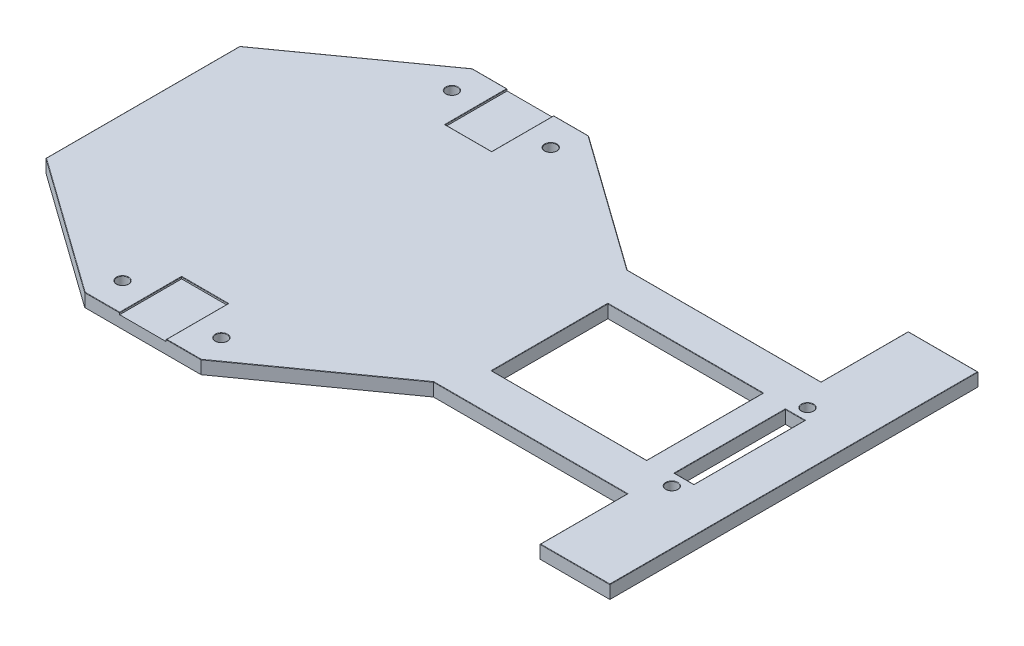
ISO-10303-21;
HEADER;
FILE_DESCRIPTION(('STEP AP214'),'2;1');
FILE_NAME('part.step','',(''),(''),'','','');
FILE_SCHEMA(('AUTOMOTIVE_DESIGN { 1 0 10303 214 1 1 1 1 }'));
ENDSEC;
DATA;
#1=APPLICATION_CONTEXT('core data for automotive mechanical design processes');
#2=APPLICATION_PROTOCOL_DEFINITION('international standard','automotive_design',2000,#1);
#3=PRODUCT_CONTEXT('',#1,'mechanical');
#4=PRODUCT('Part','Part','',(#3));
#5=PRODUCT_RELATED_PRODUCT_CATEGORY('part','',(#4));
#6=PRODUCT_DEFINITION_FORMATION('','',#4);
#7=PRODUCT_DEFINITION_CONTEXT('part definition',#1,'design');
#8=PRODUCT_DEFINITION('design','',#6,#7);
#9=PRODUCT_DEFINITION_SHAPE('','',#8);
#10=(LENGTH_UNIT() NAMED_UNIT(*) SI_UNIT(.MILLI.,.METRE.));
#11=(NAMED_UNIT(*) PLANE_ANGLE_UNIT() SI_UNIT($,.RADIAN.));
#12=(NAMED_UNIT(*) SI_UNIT($,.STERADIAN.) SOLID_ANGLE_UNIT());
#13=UNCERTAINTY_MEASURE_WITH_UNIT(LENGTH_MEASURE(1.E-05),#10,'distance_accuracy_value','');
#14=(GEOMETRIC_REPRESENTATION_CONTEXT(3) GLOBAL_UNCERTAINTY_ASSIGNED_CONTEXT((#13)) GLOBAL_UNIT_ASSIGNED_CONTEXT((#10,
#11,#12)) REPRESENTATION_CONTEXT('',''));
#15=CARTESIAN_POINT('',(0.,0.,0.));
#16=DIRECTION('',(0.,0.,1.));
#17=DIRECTION('',(1.,0.,0.));
#18=AXIS2_PLACEMENT_3D('',#15,#16,#17);
#19=CARTESIAN_POINT('',(0.,3.4,0.));
#20=DIRECTION('',(0.,-1.,0.));
#21=DIRECTION('',(0.,0.,-1.));
#22=AXIS2_PLACEMENT_3D('',#19,#20,#21);
#23=PLANE('',#22);
#24=DIRECTION('',(0.,0.,-1.));
#25=VECTOR('',#24,1.);
#26=CARTESIAN_POINT('',(56.1000000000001,3.4,0.));
#27=LINE('',#26,#25);
#28=CARTESIAN_POINT('',(56.1000000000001,3.4,-74.9));
#29=VERTEX_POINT('',#28);
#30=CARTESIAN_POINT('',(56.1000000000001,3.4,-58.9));
#31=VERTEX_POINT('',#30);
#32=EDGE_CURVE('E698',#29,#31,#27,.F.);
#33=ORIENTED_EDGE('',*,*,#32,.T.);
#34=DIRECTION('',(1.,0.,0.));
#35=VECTOR('',#34,1.);
#36=CARTESIAN_POINT('',(0.,3.4,-58.9));
#37=LINE('',#36,#35);
#38=CARTESIAN_POINT('',(43.9,3.4,-58.9));
#39=VERTEX_POINT('',#38);
#40=EDGE_CURVE('E699',#31,#39,#37,.F.);
#41=ORIENTED_EDGE('',*,*,#40,.T.);
#42=DIRECTION('',(0.,0.,1.));
#43=VECTOR('',#42,1.);
#44=CARTESIAN_POINT('',(43.9,3.4,0.));
#45=LINE('',#44,#43);
#46=CARTESIAN_POINT('',(43.9,3.4,-74.9));
#47=VERTEX_POINT('',#46);
#48=EDGE_CURVE('E638',#39,#47,#45,.F.);
#49=ORIENTED_EDGE('',*,*,#48,.T.);
#50=DIRECTION('',(-1.,0.,0.));
#51=VECTOR('',#50,1.);
#52=CARTESIAN_POINT('',(0.,3.4,-74.9));
#53=LINE('',#52,#51);
#54=CARTESIAN_POINT('',(35.0320465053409,3.4,-74.9));
#55=VERTEX_POINT('',#54);
#56=EDGE_CURVE('E640',#47,#55,#53,.T.);
#57=ORIENTED_EDGE('',*,*,#56,.T.);
#58=DIRECTION('',(-0.813733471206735,0.,0.581238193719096));
#59=VECTOR('',#58,1.);
#60=CARTESIAN_POINT('',(-23.5905248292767,3.4,-33.0267347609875));
#61=LINE('',#60,#59);
#62=CARTESIAN_POINT('',(0.0999999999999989,3.4,-49.9485382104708));
#63=VERTEX_POINT('',#62);
#64=EDGE_CURVE('E645',#55,#63,#61,.T.);
#65=ORIENTED_EDGE('',*,*,#64,.T.);
#66=DIRECTION('',(0.,0.,1.));
#67=VECTOR('',#66,1.);
#68=CARTESIAN_POINT('',(0.1,3.4,0.));
#69=LINE('',#68,#67);
#70=CARTESIAN_POINT('',(0.1,3.4,-0.0514617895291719));
#71=VERTEX_POINT('',#70);
#72=EDGE_CURVE('E642',#63,#71,#69,.T.);
#73=ORIENTED_EDGE('',*,*,#72,.T.);
#74=DIRECTION('',(0.813733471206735,0.,0.581238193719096));
#75=VECTOR('',#74,1.);
#76=CARTESIAN_POINT('',(0.0581238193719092,3.4,-0.0813733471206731));
#77=LINE('',#76,#75);
#78=CARTESIAN_POINT('',(35.0320465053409,3.4,24.9));
#79=VERTEX_POINT('',#78);
#80=EDGE_CURVE('E648',#71,#79,#77,.T.);
#81=ORIENTED_EDGE('',*,*,#80,.T.);
#82=DIRECTION('',(1.,0.,0.));
#83=VECTOR('',#82,1.);
#84=CARTESIAN_POINT('',(0.,3.4,24.9));
#85=LINE('',#84,#83);
#86=CARTESIAN_POINT('',(43.9,3.4,24.9));
#87=VERTEX_POINT('',#86);
#88=EDGE_CURVE('E651',#79,#87,#85,.T.);
#89=ORIENTED_EDGE('',*,*,#88,.T.);
#90=DIRECTION('',(0.,0.,1.));
#91=VECTOR('',#90,1.);
#92=CARTESIAN_POINT('',(43.9,3.4,0.));
#93=LINE('',#92,#91);
#94=CARTESIAN_POINT('',(43.9,3.4,8.9));
#95=VERTEX_POINT('',#94);
#96=EDGE_CURVE('E652',#87,#95,#93,.F.);
#97=ORIENTED_EDGE('',*,*,#96,.T.);
#98=DIRECTION('',(-1.,0.,0.));
#99=VECTOR('',#98,1.);
#100=CARTESIAN_POINT('',(0.,3.4,8.9));
#101=LINE('',#100,#99);
#102=CARTESIAN_POINT('',(56.1000000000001,3.4,8.9));
#103=VERTEX_POINT('',#102);
#104=EDGE_CURVE('E660',#95,#103,#101,.F.);
#105=ORIENTED_EDGE('',*,*,#104,.T.);
#106=DIRECTION('',(0.,0.,-1.));
#107=VECTOR('',#106,1.);
#108=CARTESIAN_POINT('',(56.1000000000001,3.4,0.));
#109=LINE('',#108,#107);
#110=CARTESIAN_POINT('',(56.1000000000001,3.4,24.9));
#111=VERTEX_POINT('',#110);
#112=EDGE_CURVE('E659',#103,#111,#109,.F.);
#113=ORIENTED_EDGE('',*,*,#112,.T.);
#114=DIRECTION('',(1.,0.,0.));
#115=VECTOR('',#114,1.);
#116=CARTESIAN_POINT('',(0.,3.4,24.9));
#117=LINE('',#116,#115);
#118=CARTESIAN_POINT('',(64.9679534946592,3.4,24.9));
#119=VERTEX_POINT('',#118);
#120=EDGE_CURVE('E664',#111,#119,#117,.T.);
#121=ORIENTED_EDGE('',*,*,#120,.T.);
#122=DIRECTION('',(0.813733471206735,0.,-0.581238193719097));
#123=VECTOR('',#122,1.);
#124=CARTESIAN_POINT('',(33.7256599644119,3.4,47.2159239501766));
#125=LINE('',#124,#123);
#126=CARTESIAN_POINT('',(99.9679534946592,3.4,-0.100000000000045));
#127=VERTEX_POINT('',#126);
#128=EDGE_CURVE('E666',#119,#127,#125,.T.);
#129=ORIENTED_EDGE('',*,*,#128,.T.);
#130=DIRECTION('',(1.,0.,0.));
#131=VECTOR('',#130,1.);
#132=CARTESIAN_POINT('',(0.,3.4,-0.100000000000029));
#133=LINE('',#132,#131);
#134=CARTESIAN_POINT('',(150.1,3.4,-0.10000000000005));
#135=VERTEX_POINT('',#134);
#136=EDGE_CURVE('E668',#127,#135,#133,.T.);
#137=ORIENTED_EDGE('',*,*,#136,.T.);
#138=DIRECTION('',(0.,0.,1.));
#139=VECTOR('',#138,1.);
#140=CARTESIAN_POINT('',(150.1,3.4,-1.85160528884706E-13));
#141=LINE('',#140,#139);
#142=CARTESIAN_POINT('',(150.1,3.4,22.4));
#143=VERTEX_POINT('',#142);
#144=EDGE_CURVE('E672',#135,#143,#141,.T.);
#145=ORIENTED_EDGE('',*,*,#144,.T.);
#146=DIRECTION('',(1.,0.,0.));
#147=VECTOR('',#146,1.);
#148=CARTESIAN_POINT('',(0.,3.4,22.4));
#149=LINE('',#148,#147);
#150=CARTESIAN_POINT('',(167.9,3.4,22.4));
#151=VERTEX_POINT('',#150);
#152=EDGE_CURVE('E675',#143,#151,#149,.T.);
#153=ORIENTED_EDGE('',*,*,#152,.T.);
#154=DIRECTION('',(0.,0.,-1.));
#155=VECTOR('',#154,1.);
#156=CARTESIAN_POINT('',(167.9,3.4,0.));
#157=LINE('',#156,#155);
#158=CARTESIAN_POINT('',(167.9,3.4,-72.4));
#159=VERTEX_POINT('',#158);
#160=EDGE_CURVE('E676',#151,#159,#157,.T.);
#161=ORIENTED_EDGE('',*,*,#160,.T.);
#162=DIRECTION('',(-1.,0.,0.));
#163=VECTOR('',#162,1.);
#164=CARTESIAN_POINT('',(0.,3.4,-72.4));
#165=LINE('',#164,#163);
#166=CARTESIAN_POINT('',(150.1,3.4,-72.4));
#167=VERTEX_POINT('',#166);
#168=EDGE_CURVE('E681',#159,#167,#165,.T.);
#169=ORIENTED_EDGE('',*,*,#168,.T.);
#170=DIRECTION('',(0.,0.,1.));
#171=VECTOR('',#170,1.);
#172=CARTESIAN_POINT('',(150.1,3.4,0.));
#173=LINE('',#172,#171);
#174=CARTESIAN_POINT('',(150.1,3.4,-49.9));
#175=VERTEX_POINT('',#174);
#176=EDGE_CURVE('E683',#167,#175,#173,.T.);
#177=ORIENTED_EDGE('',*,*,#176,.T.);
#178=DIRECTION('',(-1.,0.,0.));
#179=VECTOR('',#178,1.);
#180=CARTESIAN_POINT('',(0.,3.4,-49.9));
#181=LINE('',#180,#179);
#182=CARTESIAN_POINT('',(99.9679534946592,3.4,-49.9));
#183=VERTEX_POINT('',#182);
#184=EDGE_CURVE('E687',#175,#183,#181,.T.);
#185=ORIENTED_EDGE('',*,*,#184,.T.);
#186=DIRECTION('',(-0.813733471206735,0.,-0.581238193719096));
#187=VECTOR('',#186,1.);
#188=CARTESIAN_POINT('',(57.3743086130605,3.4,-80.3240320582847));
#189=LINE('',#188,#187);
#190=CARTESIAN_POINT('',(64.9679534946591,3.4,-74.9));
#191=VERTEX_POINT('',#190);
#192=EDGE_CURVE('E690',#183,#191,#189,.T.);
#193=ORIENTED_EDGE('',*,*,#192,.T.);
#194=DIRECTION('',(-1.,0.,0.));
#195=VECTOR('',#194,1.);
#196=CARTESIAN_POINT('',(0.,3.4,-74.9));
#197=LINE('',#196,#195);
#198=EDGE_CURVE('E691',#191,#29,#197,.T.);
#199=ORIENTED_EDGE('',*,*,#198,.T.);
#200=EDGE_LOOP('',(#33,#41,#49,#57,#65,#73,#81,#89,#97,#105,#113,#121,#129,#137,#145,#153,#161,
#169,#177,#185,#193,#199));
#201=FACE_BOUND('',#200,.T.);
#202=CARTESIAN_POINT('',(37.25,3.4,17.5));
#203=DIRECTION('',(0.,-1.,0.));
#204=DIRECTION('',(0.,0.,-1.));
#205=AXIS2_PLACEMENT_3D('',#202,#203,#204);
#206=CIRCLE('',#205,1.6);
#207=CARTESIAN_POINT('',(37.25,3.4,15.9));
#208=VERTEX_POINT('',#207);
#209=EDGE_CURVE('E632',#208,#208,#206,.T.);
#210=ORIENTED_EDGE('',*,*,#209,.T.);
#211=EDGE_LOOP('',(#210));
#212=FACE_BOUND('',#211,.T.);
#213=CARTESIAN_POINT('',(62.75,3.4,17.4999999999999));
#214=DIRECTION('',(0.,-1.,0.));
#215=DIRECTION('',(0.,0.,-1.));
#216=AXIS2_PLACEMENT_3D('',#213,#214,#215);
#217=CIRCLE('',#216,1.6);
#218=CARTESIAN_POINT('',(62.75,3.4,15.8999999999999));
#219=VERTEX_POINT('',#218);
#220=EDGE_CURVE('E627',#219,#219,#217,.T.);
#221=ORIENTED_EDGE('',*,*,#220,.T.);
#222=EDGE_LOOP('',(#221));
#223=FACE_BOUND('',#222,.T.);
#224=CARTESIAN_POINT('',(62.75,3.4,-67.5));
#225=DIRECTION('',(0.,-1.,0.));
#226=DIRECTION('',(0.,0.,-1.));
#227=AXIS2_PLACEMENT_3D('',#224,#225,#226);
#228=CIRCLE('',#227,1.6);
#229=CARTESIAN_POINT('',(62.75,3.4,-69.1));
#230=VERTEX_POINT('',#229);
#231=EDGE_CURVE('E624',#230,#230,#228,.T.);
#232=ORIENTED_EDGE('',*,*,#231,.T.);
#233=EDGE_LOOP('',(#232));
#234=FACE_BOUND('',#233,.T.);
#235=CARTESIAN_POINT('',(37.25,3.4,-67.5));
#236=DIRECTION('',(0.,-1.,0.));
#237=DIRECTION('',(0.,0.,-1.));
#238=AXIS2_PLACEMENT_3D('',#235,#236,#237);
#239=CIRCLE('',#238,1.6);
#240=CARTESIAN_POINT('',(37.25,3.4,-69.1));
#241=VERTEX_POINT('',#240);
#242=EDGE_CURVE('E620',#241,#241,#239,.T.);
#243=ORIENTED_EDGE('',*,*,#242,.T.);
#244=EDGE_LOOP('',(#243));
#245=FACE_BOUND('',#244,.T.);
#246=CARTESIAN_POINT('',(154.,3.4,-42.5));
#247=DIRECTION('',(0.,-1.,0.));
#248=DIRECTION('',(0.,0.,-1.));
#249=AXIS2_PLACEMENT_3D('',#246,#247,#248);
#250=CIRCLE('',#249,1.6);
#251=CARTESIAN_POINT('',(154.,3.4,-44.1000000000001));
#252=VERTEX_POINT('',#251);
#253=EDGE_CURVE('E616',#252,#252,#250,.T.);
#254=ORIENTED_EDGE('',*,*,#253,.T.);
#255=EDGE_LOOP('',(#254));
#256=FACE_BOUND('',#255,.T.);
#257=CARTESIAN_POINT('',(154.,3.4,-7.50000000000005));
#258=DIRECTION('',(0.,-1.,0.));
#259=DIRECTION('',(0.,0.,-1.));
#260=AXIS2_PLACEMENT_3D('',#257,#258,#259);
#261=CIRCLE('',#260,1.6);
#262=CARTESIAN_POINT('',(154.,3.4,-9.10000000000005));
#263=VERTEX_POINT('',#262);
#264=EDGE_CURVE('E615',#263,#263,#261,.T.);
#265=ORIENTED_EDGE('',*,*,#264,.T.);
#266=EDGE_LOOP('',(#265));
#267=FACE_BOUND('',#266,.T.);
#268=DIRECTION('',(0.,0.,1.));
#269=VECTOR('',#268,1.);
#270=CARTESIAN_POINT('',(151.4,3.4,-39.3));
#271=LINE('',#270,#269);
#272=CARTESIAN_POINT('',(151.4,3.4,-10.6));
#273=VERTEX_POINT('',#272);
#274=CARTESIAN_POINT('',(151.4,3.4,-39.4));
#275=VERTEX_POINT('',#274);
#276=EDGE_CURVE('E604',#273,#275,#271,.F.);
#277=ORIENTED_EDGE('',*,*,#276,.T.);
#278=DIRECTION('',(-1.,0.,0.));
#279=VECTOR('',#278,1.);
#280=CARTESIAN_POINT('',(156.5,3.4,-39.4));
#281=LINE('',#280,#279);
#282=CARTESIAN_POINT('',(156.6,3.4,-39.4));
#283=VERTEX_POINT('',#282);
#284=EDGE_CURVE('E609',#275,#283,#281,.F.);
#285=ORIENTED_EDGE('',*,*,#284,.T.);
#286=DIRECTION('',(0.,0.,-1.));
#287=VECTOR('',#286,1.);
#288=CARTESIAN_POINT('',(156.6,3.4,-10.7));
#289=LINE('',#288,#287);
#290=CARTESIAN_POINT('',(156.6,3.4,-10.6));
#291=VERTEX_POINT('',#290);
#292=EDGE_CURVE('E597',#283,#291,#289,.F.);
#293=ORIENTED_EDGE('',*,*,#292,.T.);
#294=DIRECTION('',(1.,0.,0.));
#295=VECTOR('',#294,1.);
#296=CARTESIAN_POINT('',(151.5,3.4,-10.6));
#297=LINE('',#296,#295);
#298=EDGE_CURVE('E605',#291,#273,#297,.F.);
#299=ORIENTED_EDGE('',*,*,#298,.T.);
#300=EDGE_LOOP('',(#277,#285,#293,#299));
#301=FACE_BOUND('',#300,.T.);
#302=DIRECTION('',(0.,0.,1.));
#303=VECTOR('',#302,1.);
#304=CARTESIAN_POINT('',(104.9,3.4,-40.));
#305=LINE('',#304,#303);
#306=CARTESIAN_POINT('',(104.9,3.4,-9.90000000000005));
#307=VERTEX_POINT('',#306);
#308=CARTESIAN_POINT('',(104.9,3.4,-40.1000000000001));
#309=VERTEX_POINT('',#308);
#310=EDGE_CURVE('E595',#307,#309,#305,.F.);
#311=ORIENTED_EDGE('',*,*,#310,.T.);
#312=DIRECTION('',(-1.,0.,0.));
#313=VECTOR('',#312,1.);
#314=CARTESIAN_POINT('',(145.,3.4,-40.1000000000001));
#315=LINE('',#314,#313);
#316=CARTESIAN_POINT('',(145.1,3.4,-40.1000000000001));
#317=VERTEX_POINT('',#316);
#318=EDGE_CURVE('E594',#309,#317,#315,.F.);
#319=ORIENTED_EDGE('',*,*,#318,.T.);
#320=DIRECTION('',(0.,0.,-1.));
#321=VECTOR('',#320,1.);
#322=CARTESIAN_POINT('',(145.1,3.4,-10.));
#323=LINE('',#322,#321);
#324=CARTESIAN_POINT('',(145.1,3.4,-9.90000000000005));
#325=VERTEX_POINT('',#324);
#326=EDGE_CURVE('E588',#317,#325,#323,.F.);
#327=ORIENTED_EDGE('',*,*,#326,.T.);
#328=DIRECTION('',(1.,0.,0.));
#329=VECTOR('',#328,1.);
#330=CARTESIAN_POINT('',(105.,3.4,-9.90000000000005));
#331=LINE('',#330,#329);
#332=EDGE_CURVE('E589',#325,#307,#331,.F.);
#333=ORIENTED_EDGE('',*,*,#332,.T.);
#334=EDGE_LOOP('',(#311,#319,#327,#333));
#335=FACE_BOUND('',#334,.T.);
#336=ADVANCED_FACE('F44',(#201,#212,#223,#234,#245,#256,#267,#301,#335),#23,.F.);
#337=CARTESIAN_POINT('',(0.,0.,0.));
#338=DIRECTION('',(0.,-1.,0.));
#339=DIRECTION('',(0.,0.,-1.));
#340=AXIS2_PLACEMENT_3D('',#337,#338,#339);
#341=PLANE('',#340);
#342=CARTESIAN_POINT('',(62.75,0.,17.4999999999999));
#343=DIRECTION('',(0.,1.,0.));
#344=DIRECTION('',(0.,0.,-1.));
#345=AXIS2_PLACEMENT_3D('',#342,#343,#344);
#346=CIRCLE('',#345,1.5);
#347=CARTESIAN_POINT('',(62.75,0.,15.9999999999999));
#348=VERTEX_POINT('',#347);
#349=EDGE_CURVE('E410',#348,#348,#346,.T.);
#350=ORIENTED_EDGE('',*,*,#349,.T.);
#351=EDGE_LOOP('',(#350));
#352=FACE_BOUND('',#351,.T.);
#353=CARTESIAN_POINT('',(37.25,0.,-67.5));
#354=DIRECTION('',(0.,1.,0.));
#355=DIRECTION('',(0.,0.,1.));
#356=AXIS2_PLACEMENT_3D('',#353,#354,#355);
#357=CIRCLE('',#356,1.5);
#358=CARTESIAN_POINT('',(37.25,0.,-66.));
#359=VERTEX_POINT('',#358);
#360=EDGE_CURVE('E418',#359,#359,#357,.T.);
#361=ORIENTED_EDGE('',*,*,#360,.T.);
#362=EDGE_LOOP('',(#361));
#363=FACE_BOUND('',#362,.T.);
#364=CARTESIAN_POINT('',(154.,0.,-7.50000000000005));
#365=DIRECTION('',(0.,1.,0.));
#366=DIRECTION('',(0.,0.,1.));
#367=AXIS2_PLACEMENT_3D('',#364,#365,#366);
#368=CIRCLE('',#367,1.5);
#369=CARTESIAN_POINT('',(154.,0.,-6.00000000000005));
#370=VERTEX_POINT('',#369);
#371=EDGE_CURVE('E424',#370,#370,#368,.T.);
#372=ORIENTED_EDGE('',*,*,#371,.T.);
#373=EDGE_LOOP('',(#372));
#374=FACE_BOUND('',#373,.T.);
#375=DIRECTION('',(0.813733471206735,0.,0.581238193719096));
#376=VECTOR('',#375,1.);
#377=CARTESIAN_POINT('',(35.,0.,25.));
#378=LINE('',#377,#376);
#379=CARTESIAN_POINT('',(0.,0.,0.));
#380=VERTEX_POINT('',#379);
#381=CARTESIAN_POINT('',(35.,0.,25.));
#382=VERTEX_POINT('',#381);
#383=EDGE_CURVE('E482',#380,#382,#378,.T.);
#384=ORIENTED_EDGE('',*,*,#383,.F.);
#385=DIRECTION('',(0.,0.,1.));
#386=VECTOR('',#385,1.);
#387=CARTESIAN_POINT('',(0.,0.,0.));
#388=LINE('',#387,#386);
#389=CARTESIAN_POINT('',(0.,0.,-50.));
#390=VERTEX_POINT('',#389);
#391=EDGE_CURVE('E536',#390,#380,#388,.T.);
#392=ORIENTED_EDGE('',*,*,#391,.F.);
#393=DIRECTION('',(-0.813733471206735,0.,0.581238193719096));
#394=VECTOR('',#393,1.);
#395=CARTESIAN_POINT('',(0.,0.,-50.));
#396=LINE('',#395,#394);
#397=CARTESIAN_POINT('',(35.,0.,-75.));
#398=VERTEX_POINT('',#397);
#399=EDGE_CURVE('E535',#398,#390,#396,.T.);
#400=ORIENTED_EDGE('',*,*,#399,.F.);
#401=DIRECTION('',(-1.,0.,0.));
#402=VECTOR('',#401,1.);
#403=CARTESIAN_POINT('',(35.,0.,-75.));
#404=LINE('',#403,#402);
#405=CARTESIAN_POINT('',(65.,0.,-75.));
#406=VERTEX_POINT('',#405);
#407=EDGE_CURVE('E526',#406,#398,#404,.T.);
#408=ORIENTED_EDGE('',*,*,#407,.F.);
#409=DIRECTION('',(-0.813733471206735,0.,-0.581238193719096));
#410=VECTOR('',#409,1.);
#411=CARTESIAN_POINT('',(65.,0.,-75.));
#412=LINE('',#411,#410);
#413=CARTESIAN_POINT('',(100.,0.,-50.));
#414=VERTEX_POINT('',#413);
#415=EDGE_CURVE('E523',#414,#406,#412,.T.);
#416=ORIENTED_EDGE('',*,*,#415,.F.);
#417=DIRECTION('',(-1.,0.,0.));
#418=VECTOR('',#417,1.);
#419=CARTESIAN_POINT('',(100.,0.,-50.));
#420=LINE('',#419,#418);
#421=CARTESIAN_POINT('',(150.,0.,-50.));
#422=VERTEX_POINT('',#421);
#423=EDGE_CURVE('E519',#422,#414,#420,.T.);
#424=ORIENTED_EDGE('',*,*,#423,.F.);
#425=DIRECTION('',(0.,0.,1.));
#426=VECTOR('',#425,1.);
#427=CARTESIAN_POINT('',(150.,0.,-50.));
#428=LINE('',#427,#426);
#429=CARTESIAN_POINT('',(150.,0.,-72.5));
#430=VERTEX_POINT('',#429);
#431=EDGE_CURVE('E516',#430,#422,#428,.T.);
#432=ORIENTED_EDGE('',*,*,#431,.F.);
#433=DIRECTION('',(-1.,0.,0.));
#434=VECTOR('',#433,1.);
#435=CARTESIAN_POINT('',(150.,0.,-72.5));
#436=LINE('',#435,#434);
#437=CARTESIAN_POINT('',(168.,0.,-72.5));
#438=VERTEX_POINT('',#437);
#439=EDGE_CURVE('E515',#438,#430,#436,.T.);
#440=ORIENTED_EDGE('',*,*,#439,.F.);
#441=DIRECTION('',(0.,0.,-1.));
#442=VECTOR('',#441,1.);
#443=CARTESIAN_POINT('',(168.,0.,-72.5));
#444=LINE('',#443,#442);
#445=CARTESIAN_POINT('',(168.,0.,22.5));
#446=VERTEX_POINT('',#445);
#447=EDGE_CURVE('E509',#446,#438,#444,.T.);
#448=ORIENTED_EDGE('',*,*,#447,.F.);
#449=DIRECTION('',(1.,0.,0.));
#450=VECTOR('',#449,1.);
#451=CARTESIAN_POINT('',(168.,0.,22.5));
#452=LINE('',#451,#450);
#453=CARTESIAN_POINT('',(150.,0.,22.5));
#454=VERTEX_POINT('',#453);
#455=EDGE_CURVE('E503',#454,#446,#452,.T.);
#456=ORIENTED_EDGE('',*,*,#455,.F.);
#457=DIRECTION('',(0.,0.,1.));
#458=VECTOR('',#457,1.);
#459=CARTESIAN_POINT('',(150.,0.,22.5));
#460=LINE('',#459,#458);
#461=CARTESIAN_POINT('',(150.,0.,0.));
#462=VERTEX_POINT('',#461);
#463=EDGE_CURVE('E498',#462,#454,#460,.T.);
#464=ORIENTED_EDGE('',*,*,#463,.F.);
#465=DIRECTION('',(1.,0.,0.));
#466=VECTOR('',#465,1.);
#467=CARTESIAN_POINT('',(150.,0.,0.));
#468=LINE('',#467,#466);
#469=CARTESIAN_POINT('',(100.,0.,0.));
#470=VERTEX_POINT('',#469);
#471=EDGE_CURVE('E497',#470,#462,#468,.T.);
#472=ORIENTED_EDGE('',*,*,#471,.F.);
#473=DIRECTION('',(0.813733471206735,0.,-0.581238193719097));
#474=VECTOR('',#473,1.);
#475=CARTESIAN_POINT('',(100.,0.,0.));
#476=LINE('',#475,#474);
#477=CARTESIAN_POINT('',(65.,0.,25.));
#478=VERTEX_POINT('',#477);
#479=EDGE_CURVE('E495',#478,#470,#476,.T.);
#480=ORIENTED_EDGE('',*,*,#479,.F.);
#481=DIRECTION('',(1.,0.,0.));
#482=VECTOR('',#481,1.);
#483=CARTESIAN_POINT('',(65.,0.,25.));
#484=LINE('',#483,#482);
#485=EDGE_CURVE('E488',#382,#478,#484,.T.);
#486=ORIENTED_EDGE('',*,*,#485,.F.);
#487=EDGE_LOOP('',(#384,#392,#400,#408,#416,#424,#432,#440,#448,#456,#464,#472,#480,#486));
#488=FACE_BOUND('',#487,.T.);
#489=DIRECTION('',(1.,0.,0.));
#490=VECTOR('',#489,1.);
#491=CARTESIAN_POINT('',(105.,0.,-10.));
#492=LINE('',#491,#490);
#493=CARTESIAN_POINT('',(105.,0.,-10.));
#494=VERTEX_POINT('',#493);
#495=CARTESIAN_POINT('',(145.,0.,-10.));
#496=VERTEX_POINT('',#495);
#497=EDGE_CURVE('E469',#494,#496,#492,.T.);
#498=ORIENTED_EDGE('',*,*,#497,.T.);
#499=DIRECTION('',(0.,0.,-1.));
#500=VECTOR('',#499,1.);
#501=CARTESIAN_POINT('',(145.,0.,-10.));
#502=LINE('',#501,#500);
#503=CARTESIAN_POINT('',(145.,0.,-40.));
#504=VERTEX_POINT('',#503);
#505=EDGE_CURVE('E457',#496,#504,#502,.T.);
#506=ORIENTED_EDGE('',*,*,#505,.T.);
#507=DIRECTION('',(-1.,0.,0.));
#508=VECTOR('',#507,1.);
#509=CARTESIAN_POINT('',(105.,0.,-40.));
#510=LINE('',#509,#508);
#511=CARTESIAN_POINT('',(105.,0.,-40.));
#512=VERTEX_POINT('',#511);
#513=EDGE_CURVE('E458',#504,#512,#510,.T.);
#514=ORIENTED_EDGE('',*,*,#513,.T.);
#515=DIRECTION('',(0.,0.,1.));
#516=VECTOR('',#515,1.);
#517=CARTESIAN_POINT('',(105.,0.,-10.));
#518=LINE('',#517,#516);
#519=EDGE_CURVE('E463',#512,#494,#518,.T.);
#520=ORIENTED_EDGE('',*,*,#519,.T.);
#521=EDGE_LOOP('',(#498,#506,#514,#520));
#522=FACE_BOUND('',#521,.T.);
#523=DIRECTION('',(1.,0.,0.));
#524=VECTOR('',#523,1.);
#525=CARTESIAN_POINT('',(151.5,0.,-10.7));
#526=LINE('',#525,#524);
#527=CARTESIAN_POINT('',(151.5,0.,-10.7));
#528=VERTEX_POINT('',#527);
#529=CARTESIAN_POINT('',(156.5,0.,-10.7));
#530=VERTEX_POINT('',#529);
#531=EDGE_CURVE('E439',#528,#530,#526,.T.);
#532=ORIENTED_EDGE('',*,*,#531,.T.);
#533=DIRECTION('',(0.,0.,-1.));
#534=VECTOR('',#533,1.);
#535=CARTESIAN_POINT('',(156.5,0.,-10.7));
#536=LINE('',#535,#534);
#537=CARTESIAN_POINT('',(156.5,0.,-39.3));
#538=VERTEX_POINT('',#537);
#539=EDGE_CURVE('E428',#530,#538,#536,.T.);
#540=ORIENTED_EDGE('',*,*,#539,.T.);
#541=DIRECTION('',(-1.,0.,0.));
#542=VECTOR('',#541,1.);
#543=CARTESIAN_POINT('',(151.5,0.,-39.3));
#544=LINE('',#543,#542);
#545=CARTESIAN_POINT('',(151.5,0.,-39.3));
#546=VERTEX_POINT('',#545);
#547=EDGE_CURVE('E435',#538,#546,#544,.T.);
#548=ORIENTED_EDGE('',*,*,#547,.T.);
#549=DIRECTION('',(0.,0.,1.));
#550=VECTOR('',#549,1.);
#551=CARTESIAN_POINT('',(151.5,0.,-10.7));
#552=LINE('',#551,#550);
#553=EDGE_CURVE('E436',#546,#528,#552,.T.);
#554=ORIENTED_EDGE('',*,*,#553,.T.);
#555=EDGE_LOOP('',(#532,#540,#548,#554));
#556=FACE_BOUND('',#555,.T.);
#557=CARTESIAN_POINT('',(154.,0.,-42.5));
#558=DIRECTION('',(0.,1.,0.));
#559=DIRECTION('',(0.,0.,1.));
#560=AXIS2_PLACEMENT_3D('',#557,#558,#559);
#561=CIRCLE('',#560,1.5);
#562=CARTESIAN_POINT('',(154.,0.,-41.0000000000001));
#563=VERTEX_POINT('',#562);
#564=EDGE_CURVE('E419',#563,#563,#561,.T.);
#565=ORIENTED_EDGE('',*,*,#564,.T.);
#566=EDGE_LOOP('',(#565));
#567=FACE_BOUND('',#566,.T.);
#568=CARTESIAN_POINT('',(62.75,0.,-67.5));
#569=DIRECTION('',(0.,1.,0.));
#570=DIRECTION('',(0.,0.,1.));
#571=AXIS2_PLACEMENT_3D('',#568,#569,#570);
#572=CIRCLE('',#571,1.5);
#573=CARTESIAN_POINT('',(62.75,0.,-66.));
#574=VERTEX_POINT('',#573);
#575=EDGE_CURVE('E412',#574,#574,#572,.T.);
#576=ORIENTED_EDGE('',*,*,#575,.T.);
#577=EDGE_LOOP('',(#576));
#578=FACE_BOUND('',#577,.T.);
#579=CARTESIAN_POINT('',(37.25,0.,17.5));
#580=DIRECTION('',(0.,1.,0.));
#581=DIRECTION('',(0.,0.,-1.));
#582=AXIS2_PLACEMENT_3D('',#579,#580,#581);
#583=CIRCLE('',#582,1.5);
#584=CARTESIAN_POINT('',(37.25,0.,16.));
#585=VERTEX_POINT('',#584);
#586=EDGE_CURVE('E401',#585,#585,#583,.T.);
#587=ORIENTED_EDGE('',*,*,#586,.T.);
#588=EDGE_LOOP('',(#587));
#589=FACE_BOUND('',#588,.T.);
#590=ADVANCED_FACE('F944',(#352,#363,#374,#488,#522,#556,#567,#578,#589),#341,.T.);
#591=CARTESIAN_POINT('',(35.,3.4,25.));
#592=DIRECTION('',(0.581238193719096,0.,-0.813733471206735));
#593=DIRECTION('',(-0.813733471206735,0.,-0.581238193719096));
#594=AXIS2_PLACEMENT_3D('',#591,#592,#593);
#595=PLANE('',#594);
#596=DIRECTION('',(0.,-1.,0.));
#597=VECTOR('',#596,1.);
#598=CARTESIAN_POINT('',(35.,3.4,25.));
#599=LINE('',#598,#597);
#600=CARTESIAN_POINT('',(35.,3.3,25.));
#601=VERTEX_POINT('',#600);
#602=EDGE_CURVE('E578',#601,#382,#599,.T.);
#603=ORIENTED_EDGE('',*,*,#602,.F.);
#604=DIRECTION('',(0.813733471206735,0.,0.581238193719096));
#605=VECTOR('',#604,1.);
#606=CARTESIAN_POINT('',(35.,3.3,25.));
#607=LINE('',#606,#605);
#608=CARTESIAN_POINT('',(0.,3.3,0.));
#609=VERTEX_POINT('',#608);
#610=EDGE_CURVE('E751',#601,#609,#607,.F.);
#611=ORIENTED_EDGE('',*,*,#610,.T.);
#612=DIRECTION('',(0.,-1.,0.));
#613=VECTOR('',#612,1.);
#614=CARTESIAN_POINT('',(0.,3.4,0.));
#615=LINE('',#614,#613);
#616=EDGE_CURVE('E539',#609,#380,#615,.T.);
#617=ORIENTED_EDGE('',*,*,#616,.T.);
#618=ORIENTED_EDGE('',*,*,#383,.T.);
#619=EDGE_LOOP('',(#603,#611,#617,#618));
#620=FACE_BOUND('',#619,.T.);
#621=ADVANCED_FACE('F969',(#620),#595,.F.);
#622=CARTESIAN_POINT('',(65.,3.4,25.));
#623=DIRECTION('',(0.,0.,-1.));
#624=DIRECTION('',(-1.,0.,0.));
#625=AXIS2_PLACEMENT_3D('',#622,#623,#624);
#626=PLANE('',#625);
#627=DIRECTION('',(0.,-1.,0.));
#628=VECTOR('',#627,1.);
#629=CARTESIAN_POINT('',(65.,3.4,25.));
#630=LINE('',#629,#628);
#631=CARTESIAN_POINT('',(65.,3.3,25.));
#632=VERTEX_POINT('',#631);
#633=EDGE_CURVE('E576',#632,#478,#630,.T.);
#634=ORIENTED_EDGE('',*,*,#633,.F.);
#635=DIRECTION('',(1.,0.,0.));
#636=VECTOR('',#635,1.);
#637=CARTESIAN_POINT('',(65.,3.3,25.));
#638=LINE('',#637,#636);
#639=CARTESIAN_POINT('',(56.,3.3,25.));
#640=VERTEX_POINT('',#639);
#641=EDGE_CURVE('E741',#632,#640,#638,.F.);
#642=ORIENTED_EDGE('',*,*,#641,.T.);
#643=DIRECTION('',(0.,1.,0.));
#644=VECTOR('',#643,1.);
#645=CARTESIAN_POINT('',(56.,2.9,25.));
#646=LINE('',#645,#644);
#647=CARTESIAN_POINT('',(56.,2.9,25.));
#648=VERTEX_POINT('',#647);
#649=EDGE_CURVE('E375',#648,#640,#646,.T.);
#650=ORIENTED_EDGE('',*,*,#649,.F.);
#651=DIRECTION('',(1.,0.,0.));
#652=VECTOR('',#651,1.);
#653=CARTESIAN_POINT('',(56.,2.9,25.));
#654=LINE('',#653,#652);
#655=CARTESIAN_POINT('',(44.,2.9,25.));
#656=VERTEX_POINT('',#655);
#657=EDGE_CURVE('E357',#656,#648,#654,.T.);
#658=ORIENTED_EDGE('',*,*,#657,.F.);
#659=DIRECTION('',(0.,1.,0.));
#660=VECTOR('',#659,1.);
#661=CARTESIAN_POINT('',(44.,2.9,25.));
#662=LINE('',#661,#660);
#663=CARTESIAN_POINT('',(44.,3.3,25.));
#664=VERTEX_POINT('',#663);
#665=EDGE_CURVE('E384',#656,#664,#662,.T.);
#666=ORIENTED_EDGE('',*,*,#665,.T.);
#667=DIRECTION('',(1.,0.,0.));
#668=VECTOR('',#667,1.);
#669=CARTESIAN_POINT('',(65.,3.3,25.));
#670=LINE('',#669,#668);
#671=EDGE_CURVE('E737',#664,#601,#670,.F.);
#672=ORIENTED_EDGE('',*,*,#671,.T.);
#673=ORIENTED_EDGE('',*,*,#602,.T.);
#674=ORIENTED_EDGE('',*,*,#485,.T.);
#675=EDGE_LOOP('',(#634,#642,#650,#658,#666,#672,#673,#674));
#676=FACE_BOUND('',#675,.T.);
#677=ADVANCED_FACE('F1022',(#676),#626,.F.);
#678=CARTESIAN_POINT('',(100.,3.4,0.));
#679=DIRECTION('',(-0.581238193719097,0.,-0.813733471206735));
#680=DIRECTION('',(-0.813733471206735,0.,0.581238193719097));
#681=AXIS2_PLACEMENT_3D('',#678,#679,#680);
#682=PLANE('',#681);
#683=DIRECTION('',(0.,-1.,0.));
#684=VECTOR('',#683,1.);
#685=CARTESIAN_POINT('',(100.,3.4,0.));
#686=LINE('',#685,#684);
#687=CARTESIAN_POINT('',(100.,3.3,0.));
#688=VERTEX_POINT('',#687);
#689=EDGE_CURVE('E572',#688,#470,#686,.T.);
#690=ORIENTED_EDGE('',*,*,#689,.F.);
#691=DIRECTION('',(0.813733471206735,0.,-0.581238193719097));
#692=VECTOR('',#691,1.);
#693=CARTESIAN_POINT('',(100.,3.3,0.));
#694=LINE('',#693,#692);
#695=EDGE_CURVE('E733',#688,#632,#694,.F.);
#696=ORIENTED_EDGE('',*,*,#695,.T.);
#697=ORIENTED_EDGE('',*,*,#633,.T.);
#698=ORIENTED_EDGE('',*,*,#479,.T.);
#699=EDGE_LOOP('',(#690,#696,#697,#698));
#700=FACE_BOUND('',#699,.T.);
#701=ADVANCED_FACE('F1019',(#700),#682,.F.);
#702=CARTESIAN_POINT('',(150.,3.4,0.));
#703=DIRECTION('',(0.,0.,-1.));
#704=DIRECTION('',(-1.,0.,0.));
#705=AXIS2_PLACEMENT_3D('',#702,#703,#704);
#706=PLANE('',#705);
#707=DIRECTION('',(0.,-1.,0.));
#708=VECTOR('',#707,1.);
#709=CARTESIAN_POINT('',(150.,3.4,0.));
#710=LINE('',#709,#708);
#711=CARTESIAN_POINT('',(150.,3.3,0.));
#712=VERTEX_POINT('',#711);
#713=EDGE_CURVE('E568',#712,#462,#710,.T.);
#714=ORIENTED_EDGE('',*,*,#713,.F.);
#715=DIRECTION('',(1.,0.,0.));
#716=VECTOR('',#715,1.);
#717=CARTESIAN_POINT('',(150.,3.3,0.));
#718=LINE('',#717,#716);
#719=EDGE_CURVE('E735',#712,#688,#718,.F.);
#720=ORIENTED_EDGE('',*,*,#719,.T.);
#721=ORIENTED_EDGE('',*,*,#689,.T.);
#722=ORIENTED_EDGE('',*,*,#471,.T.);
#723=EDGE_LOOP('',(#714,#720,#721,#722));
#724=FACE_BOUND('',#723,.T.);
#725=ADVANCED_FACE('F1013',(#724),#706,.F.);
#726=CARTESIAN_POINT('',(150.,3.4,22.5));
#727=DIRECTION('',(1.,0.,0.));
#728=DIRECTION('',(0.,0.,-1.));
#729=AXIS2_PLACEMENT_3D('',#726,#727,#728);
#730=PLANE('',#729);
#731=DIRECTION('',(0.,-1.,0.));
#732=VECTOR('',#731,1.);
#733=CARTESIAN_POINT('',(150.,3.4,22.5));
#734=LINE('',#733,#732);
#735=CARTESIAN_POINT('',(150.,3.3,22.5));
#736=VERTEX_POINT('',#735);
#737=EDGE_CURVE('E570',#736,#454,#734,.T.);
#738=ORIENTED_EDGE('',*,*,#737,.F.);
#739=DIRECTION('',(0.,0.,1.));
#740=VECTOR('',#739,1.);
#741=CARTESIAN_POINT('',(150.,3.3,22.5));
#742=LINE('',#741,#740);
#743=EDGE_CURVE('E728',#736,#712,#742,.F.);
#744=ORIENTED_EDGE('',*,*,#743,.T.);
#745=ORIENTED_EDGE('',*,*,#713,.T.);
#746=ORIENTED_EDGE('',*,*,#463,.T.);
#747=EDGE_LOOP('',(#738,#744,#745,#746));
#748=FACE_BOUND('',#747,.T.);
#749=ADVANCED_FACE('F1008',(#748),#730,.F.);
#750=CARTESIAN_POINT('',(168.,3.4,22.5));
#751=DIRECTION('',(0.,0.,-1.));
#752=DIRECTION('',(-1.,0.,0.));
#753=AXIS2_PLACEMENT_3D('',#750,#751,#752);
#754=PLANE('',#753);
#755=DIRECTION('',(0.,-1.,0.));
#756=VECTOR('',#755,1.);
#757=CARTESIAN_POINT('',(168.,3.4,22.5));
#758=LINE('',#757,#756);
#759=CARTESIAN_POINT('',(168.,3.3,22.5));
#760=VERTEX_POINT('',#759);
#761=EDGE_CURVE('E563',#760,#446,#758,.T.);
#762=ORIENTED_EDGE('',*,*,#761,.F.);
#763=DIRECTION('',(1.,0.,0.));
#764=VECTOR('',#763,1.);
#765=CARTESIAN_POINT('',(168.,3.3,22.5));
#766=LINE('',#765,#764);
#767=EDGE_CURVE('E726',#760,#736,#766,.F.);
#768=ORIENTED_EDGE('',*,*,#767,.T.);
#769=ORIENTED_EDGE('',*,*,#737,.T.);
#770=ORIENTED_EDGE('',*,*,#455,.T.);
#771=EDGE_LOOP('',(#762,#768,#769,#770));
#772=FACE_BOUND('',#771,.T.);
#773=ADVANCED_FACE('F1007',(#772),#754,.F.);
#774=CARTESIAN_POINT('',(168.,3.4,-72.5));
#775=DIRECTION('',(-1.,0.,0.));
#776=DIRECTION('',(0.,0.,1.));
#777=AXIS2_PLACEMENT_3D('',#774,#775,#776);
#778=PLANE('',#777);
#779=DIRECTION('',(0.,-1.,0.));
#780=VECTOR('',#779,1.);
#781=CARTESIAN_POINT('',(168.,3.4,-72.5));
#782=LINE('',#781,#780);
#783=CARTESIAN_POINT('',(168.,3.3,-72.5));
#784=VERTEX_POINT('',#783);
#785=EDGE_CURVE('E561',#784,#438,#782,.T.);
#786=ORIENTED_EDGE('',*,*,#785,.F.);
#787=DIRECTION('',(0.,0.,-1.));
#788=VECTOR('',#787,1.);
#789=CARTESIAN_POINT('',(168.,3.3,-72.5));
#790=LINE('',#789,#788);
#791=EDGE_CURVE('E722',#784,#760,#790,.F.);
#792=ORIENTED_EDGE('',*,*,#791,.T.);
#793=ORIENTED_EDGE('',*,*,#761,.T.);
#794=ORIENTED_EDGE('',*,*,#447,.T.);
#795=EDGE_LOOP('',(#786,#792,#793,#794));
#796=FACE_BOUND('',#795,.T.);
#797=ADVANCED_FACE('F1002',(#796),#778,.F.);
#798=CARTESIAN_POINT('',(150.,3.4,-72.5));
#799=DIRECTION('',(0.,0.,1.));
#800=DIRECTION('',(1.,0.,0.));
#801=AXIS2_PLACEMENT_3D('',#798,#799,#800);
#802=PLANE('',#801);
#803=DIRECTION('',(0.,-1.,0.));
#804=VECTOR('',#803,1.);
#805=CARTESIAN_POINT('',(150.,3.4,-72.5));
#806=LINE('',#805,#804);
#807=CARTESIAN_POINT('',(150.,3.3,-72.5));
#808=VERTEX_POINT('',#807);
#809=EDGE_CURVE('E557',#808,#430,#806,.T.);
#810=ORIENTED_EDGE('',*,*,#809,.F.);
#811=DIRECTION('',(-1.,0.,0.));
#812=VECTOR('',#811,1.);
#813=CARTESIAN_POINT('',(150.,3.3,-72.5));
#814=LINE('',#813,#812);
#815=EDGE_CURVE('E718',#808,#784,#814,.F.);
#816=ORIENTED_EDGE('',*,*,#815,.T.);
#817=ORIENTED_EDGE('',*,*,#785,.T.);
#818=ORIENTED_EDGE('',*,*,#439,.T.);
#819=EDGE_LOOP('',(#810,#816,#817,#818));
#820=FACE_BOUND('',#819,.T.);
#821=ADVANCED_FACE('F997',(#820),#802,.F.);
#822=CARTESIAN_POINT('',(150.,3.4,-50.));
#823=DIRECTION('',(1.,0.,0.));
#824=DIRECTION('',(0.,0.,-1.));
#825=AXIS2_PLACEMENT_3D('',#822,#823,#824);
#826=PLANE('',#825);
#827=DIRECTION('',(0.,-1.,0.));
#828=VECTOR('',#827,1.);
#829=CARTESIAN_POINT('',(150.,3.4,-50.));
#830=LINE('',#829,#828);
#831=CARTESIAN_POINT('',(150.,3.3,-50.));
#832=VERTEX_POINT('',#831);
#833=EDGE_CURVE('E553',#832,#422,#830,.T.);
#834=ORIENTED_EDGE('',*,*,#833,.F.);
#835=DIRECTION('',(0.,0.,1.));
#836=VECTOR('',#835,1.);
#837=CARTESIAN_POINT('',(150.,3.3,-50.));
#838=LINE('',#837,#836);
#839=EDGE_CURVE('E720',#832,#808,#838,.F.);
#840=ORIENTED_EDGE('',*,*,#839,.T.);
#841=ORIENTED_EDGE('',*,*,#809,.T.);
#842=ORIENTED_EDGE('',*,*,#431,.T.);
#843=EDGE_LOOP('',(#834,#840,#841,#842));
#844=FACE_BOUND('',#843,.T.);
#845=ADVANCED_FACE('F991',(#844),#826,.F.);
#846=CARTESIAN_POINT('',(100.,3.4,-50.));
#847=DIRECTION('',(0.,0.,1.));
#848=DIRECTION('',(1.,0.,0.));
#849=AXIS2_PLACEMENT_3D('',#846,#847,#848);
#850=PLANE('',#849);
#851=DIRECTION('',(0.,-1.,0.));
#852=VECTOR('',#851,1.);
#853=CARTESIAN_POINT('',(100.,3.4,-50.));
#854=LINE('',#853,#852);
#855=CARTESIAN_POINT('',(100.,3.3,-50.));
#856=VERTEX_POINT('',#855);
#857=EDGE_CURVE('E555',#856,#414,#854,.T.);
#858=ORIENTED_EDGE('',*,*,#857,.F.);
#859=DIRECTION('',(-1.,0.,0.));
#860=VECTOR('',#859,1.);
#861=CARTESIAN_POINT('',(100.,3.3,-50.));
#862=LINE('',#861,#860);
#863=EDGE_CURVE('E713',#856,#832,#862,.F.);
#864=ORIENTED_EDGE('',*,*,#863,.T.);
#865=ORIENTED_EDGE('',*,*,#833,.T.);
#866=ORIENTED_EDGE('',*,*,#423,.T.);
#867=EDGE_LOOP('',(#858,#864,#865,#866));
#868=FACE_BOUND('',#867,.T.);
#869=ADVANCED_FACE('F989',(#868),#850,.F.);
#870=CARTESIAN_POINT('',(65.,3.4,-75.));
#871=DIRECTION('',(-0.581238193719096,0.,0.813733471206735));
#872=DIRECTION('',(0.813733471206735,0.,0.581238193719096));
#873=AXIS2_PLACEMENT_3D('',#870,#871,#872);
#874=PLANE('',#873);
#875=DIRECTION('',(0.,-1.,0.));
#876=VECTOR('',#875,1.);
#877=CARTESIAN_POINT('',(65.,3.4,-75.));
#878=LINE('',#877,#876);
#879=CARTESIAN_POINT('',(65.,3.3,-75.));
#880=VERTEX_POINT('',#879);
#881=EDGE_CURVE('E548',#880,#406,#878,.T.);
#882=ORIENTED_EDGE('',*,*,#881,.F.);
#883=DIRECTION('',(-0.813733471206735,0.,-0.581238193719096));
#884=VECTOR('',#883,1.);
#885=CARTESIAN_POINT('',(65.,3.3,-75.));
#886=LINE('',#885,#884);
#887=EDGE_CURVE('E711',#880,#856,#886,.F.);
#888=ORIENTED_EDGE('',*,*,#887,.T.);
#889=ORIENTED_EDGE('',*,*,#857,.T.);
#890=ORIENTED_EDGE('',*,*,#415,.T.);
#891=EDGE_LOOP('',(#882,#888,#889,#890));
#892=FACE_BOUND('',#891,.T.);
#893=ADVANCED_FACE('F990',(#892),#874,.F.);
#894=CARTESIAN_POINT('',(35.,3.4,-75.));
#895=DIRECTION('',(0.,0.,1.));
#896=DIRECTION('',(1.,0.,0.));
#897=AXIS2_PLACEMENT_3D('',#894,#895,#896);
#898=PLANE('',#897);
#899=DIRECTION('',(0.,1.,0.));
#900=VECTOR('',#899,1.);
#901=CARTESIAN_POINT('',(56.,2.9,-75.));
#902=LINE('',#901,#900);
#903=CARTESIAN_POINT('',(56.,2.9,-75.));
#904=VERTEX_POINT('',#903);
#905=CARTESIAN_POINT('',(56.,3.3,-75.));
#906=VERTEX_POINT('',#905);
#907=EDGE_CURVE('E407',#904,#906,#902,.T.);
#908=ORIENTED_EDGE('',*,*,#907,.T.);
#909=DIRECTION('',(-1.,0.,0.));
#910=VECTOR('',#909,1.);
#911=CARTESIAN_POINT('',(35.,3.3,-75.));
#912=LINE('',#911,#910);
#913=EDGE_CURVE('E708',#906,#880,#912,.F.);
#914=ORIENTED_EDGE('',*,*,#913,.T.);
#915=ORIENTED_EDGE('',*,*,#881,.T.);
#916=ORIENTED_EDGE('',*,*,#407,.T.);
#917=DIRECTION('',(0.,-1.,0.));
#918=VECTOR('',#917,1.);
#919=CARTESIAN_POINT('',(35.,3.4,-75.));
#920=LINE('',#919,#918);
#921=CARTESIAN_POINT('',(35.,3.3,-75.));
#922=VERTEX_POINT('',#921);
#923=EDGE_CURVE('E546',#922,#398,#920,.T.);
#924=ORIENTED_EDGE('',*,*,#923,.F.);
#925=DIRECTION('',(-1.,0.,0.));
#926=VECTOR('',#925,1.);
#927=CARTESIAN_POINT('',(35.,3.3,-75.));
#928=LINE('',#927,#926);
#929=CARTESIAN_POINT('',(44.,3.3,-75.));
#930=VERTEX_POINT('',#929);
#931=EDGE_CURVE('E362',#922,#930,#928,.F.);
#932=ORIENTED_EDGE('',*,*,#931,.T.);
#933=DIRECTION('',(0.,1.,0.));
#934=VECTOR('',#933,1.);
#935=CARTESIAN_POINT('',(44.,2.9,-75.));
#936=LINE('',#935,#934);
#937=CARTESIAN_POINT('',(44.,2.9,-75.));
#938=VERTEX_POINT('',#937);
#939=EDGE_CURVE('E337',#938,#930,#936,.T.);
#940=ORIENTED_EDGE('',*,*,#939,.F.);
#941=DIRECTION('',(-1.,0.,0.));
#942=VECTOR('',#941,1.);
#943=CARTESIAN_POINT('',(44.,2.9,-75.));
#944=LINE('',#943,#942);
#945=EDGE_CURVE('E350',#904,#938,#944,.T.);
#946=ORIENTED_EDGE('',*,*,#945,.F.);
#947=EDGE_LOOP('',(#908,#914,#915,#916,#924,#932,#940,#946));
#948=FACE_BOUND('',#947,.T.);
#949=ADVANCED_FACE('F358',(#948),#898,.F.);
#950=CARTESIAN_POINT('',(0.,3.4,-50.));
#951=DIRECTION('',(0.581238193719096,0.,0.813733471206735));
#952=DIRECTION('',(0.813733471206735,0.,-0.581238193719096));
#953=AXIS2_PLACEMENT_3D('',#950,#951,#952);
#954=PLANE('',#953);
#955=DIRECTION('',(0.,-1.,0.));
#956=VECTOR('',#955,1.);
#957=CARTESIAN_POINT('',(0.,3.4,-50.));
#958=LINE('',#957,#956);
#959=CARTESIAN_POINT('',(0.,3.3,-50.));
#960=VERTEX_POINT('',#959);
#961=EDGE_CURVE('E543',#960,#390,#958,.T.);
#962=ORIENTED_EDGE('',*,*,#961,.F.);
#963=DIRECTION('',(-0.813733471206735,0.,0.581238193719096));
#964=VECTOR('',#963,1.);
#965=CARTESIAN_POINT('',(0.,3.3,-50.));
#966=LINE('',#965,#964);
#967=EDGE_CURVE('E757',#960,#922,#966,.F.);
#968=ORIENTED_EDGE('',*,*,#967,.T.);
#969=ORIENTED_EDGE('',*,*,#923,.T.);
#970=ORIENTED_EDGE('',*,*,#399,.T.);
#971=EDGE_LOOP('',(#962,#968,#969,#970));
#972=FACE_BOUND('',#971,.T.);
#973=ADVANCED_FACE('F979',(#972),#954,.F.);
#974=CARTESIAN_POINT('',(0.,3.4,0.));
#975=DIRECTION('',(1.,0.,0.));
#976=DIRECTION('',(0.,0.,-1.));
#977=AXIS2_PLACEMENT_3D('',#974,#975,#976);
#978=PLANE('',#977);
#979=ORIENTED_EDGE('',*,*,#616,.F.);
#980=DIRECTION('',(0.,0.,1.));
#981=VECTOR('',#980,1.);
#982=CARTESIAN_POINT('',(0.,3.3,0.));
#983=LINE('',#982,#981);
#984=EDGE_CURVE('E756',#609,#960,#983,.F.);
#985=ORIENTED_EDGE('',*,*,#984,.T.);
#986=ORIENTED_EDGE('',*,*,#961,.T.);
#987=ORIENTED_EDGE('',*,*,#391,.T.);
#988=EDGE_LOOP('',(#979,#985,#986,#987));
#989=FACE_BOUND('',#988,.T.);
#990=ADVANCED_FACE('F980',(#989),#978,.F.);
#991=CARTESIAN_POINT('',(145.,3.4,-10.));
#992=DIRECTION('',(-1.,0.,0.));
#993=DIRECTION('',(0.,0.,1.));
#994=AXIS2_PLACEMENT_3D('',#991,#992,#993);
#995=PLANE('',#994);
#996=DIRECTION('',(0.,-1.,0.));
#997=VECTOR('',#996,1.);
#998=CARTESIAN_POINT('',(145.,3.4,-10.));
#999=LINE('',#998,#997);
#1000=CARTESIAN_POINT('',(145.,3.3,-10.));
#1001=VERTEX_POINT('',#1000);
#1002=EDGE_CURVE('E472',#1001,#496,#999,.T.);
#1003=ORIENTED_EDGE('',*,*,#1002,.F.);
#1004=DIRECTION('',(0.,0.,-1.));
#1005=VECTOR('',#1004,1.);
#1006=CARTESIAN_POINT('',(145.,3.3,-40.));
#1007=LINE('',#1006,#1005);
#1008=CARTESIAN_POINT('',(145.,3.3,-40.));
#1009=VERTEX_POINT('',#1008);
#1010=EDGE_CURVE('E11',#1001,#1009,#1007,.T.);
#1011=ORIENTED_EDGE('',*,*,#1010,.T.);
#1012=DIRECTION('',(0.,-1.,0.));
#1013=VECTOR('',#1012,1.);
#1014=CARTESIAN_POINT('',(145.,3.4,-40.));
#1015=LINE('',#1014,#1013);
#1016=EDGE_CURVE('E481',#1009,#504,#1015,.T.);
#1017=ORIENTED_EDGE('',*,*,#1016,.T.);
#1018=ORIENTED_EDGE('',*,*,#505,.F.);
#1019=EDGE_LOOP('',(#1003,#1011,#1017,#1018));
#1020=FACE_BOUND('',#1019,.T.);
#1021=ADVANCED_FACE('F948',(#1020),#995,.T.);
#1022=CARTESIAN_POINT('',(105.,3.4,-40.));
#1023=DIRECTION('',(0.,0.,1.));
#1024=DIRECTION('',(1.,0.,0.));
#1025=AXIS2_PLACEMENT_3D('',#1022,#1023,#1024);
#1026=PLANE('',#1025);
#1027=ORIENTED_EDGE('',*,*,#1016,.F.);
#1028=DIRECTION('',(-1.,0.,0.));
#1029=VECTOR('',#1028,1.);
#1030=CARTESIAN_POINT('',(105.,3.3,-40.));
#1031=LINE('',#1030,#1029);
#1032=CARTESIAN_POINT('',(105.,3.3,-40.));
#1033=VERTEX_POINT('',#1032);
#1034=EDGE_CURVE('E802',#1009,#1033,#1031,.T.);
#1035=ORIENTED_EDGE('',*,*,#1034,.T.);
#1036=DIRECTION('',(0.,-1.,0.));
#1037=VECTOR('',#1036,1.);
#1038=CARTESIAN_POINT('',(105.,3.4,-40.));
#1039=LINE('',#1038,#1037);
#1040=EDGE_CURVE('E476',#1033,#512,#1039,.T.);
#1041=ORIENTED_EDGE('',*,*,#1040,.T.);
#1042=ORIENTED_EDGE('',*,*,#513,.F.);
#1043=EDGE_LOOP('',(#1027,#1035,#1041,#1042));
#1044=FACE_BOUND('',#1043,.T.);
#1045=ADVANCED_FACE('F936',(#1044),#1026,.T.);
#1046=CARTESIAN_POINT('',(105.,3.4,-10.));
#1047=DIRECTION('',(1.,0.,0.));
#1048=DIRECTION('',(0.,0.,-1.));
#1049=AXIS2_PLACEMENT_3D('',#1046,#1047,#1048);
#1050=PLANE('',#1049);
#1051=ORIENTED_EDGE('',*,*,#1040,.F.);
#1052=DIRECTION('',(0.,0.,1.));
#1053=VECTOR('',#1052,1.);
#1054=CARTESIAN_POINT('',(105.,3.3,-10.));
#1055=LINE('',#1054,#1053);
#1056=CARTESIAN_POINT('',(105.,3.3,-10.));
#1057=VERTEX_POINT('',#1056);
#1058=EDGE_CURVE('E70',#1033,#1057,#1055,.T.);
#1059=ORIENTED_EDGE('',*,*,#1058,.T.);
#1060=DIRECTION('',(0.,-1.,0.));
#1061=VECTOR('',#1060,1.);
#1062=CARTESIAN_POINT('',(105.,3.4,-10.));
#1063=LINE('',#1062,#1061);
#1064=EDGE_CURVE('E474',#1057,#494,#1063,.T.);
#1065=ORIENTED_EDGE('',*,*,#1064,.T.);
#1066=ORIENTED_EDGE('',*,*,#519,.F.);
#1067=EDGE_LOOP('',(#1051,#1059,#1065,#1066));
#1068=FACE_BOUND('',#1067,.T.);
#1069=ADVANCED_FACE('F945',(#1068),#1050,.T.);
#1070=CARTESIAN_POINT('',(105.,3.4,-10.));
#1071=DIRECTION('',(0.,0.,-1.));
#1072=DIRECTION('',(-1.,0.,0.));
#1073=AXIS2_PLACEMENT_3D('',#1070,#1071,#1072);
#1074=PLANE('',#1073);
#1075=ORIENTED_EDGE('',*,*,#1064,.F.);
#1076=DIRECTION('',(1.,0.,0.));
#1077=VECTOR('',#1076,1.);
#1078=CARTESIAN_POINT('',(145.,3.3,-10.));
#1079=LINE('',#1078,#1077);
#1080=EDGE_CURVE('E54',#1057,#1001,#1079,.T.);
#1081=ORIENTED_EDGE('',*,*,#1080,.T.);
#1082=ORIENTED_EDGE('',*,*,#1002,.T.);
#1083=ORIENTED_EDGE('',*,*,#497,.F.);
#1084=EDGE_LOOP('',(#1075,#1081,#1082,#1083));
#1085=FACE_BOUND('',#1084,.T.);
#1086=ADVANCED_FACE('F950',(#1085),#1074,.T.);
#1087=CARTESIAN_POINT('',(156.5,3.4,-10.7));
#1088=DIRECTION('',(-1.,0.,0.));
#1089=DIRECTION('',(0.,0.,1.));
#1090=AXIS2_PLACEMENT_3D('',#1087,#1088,#1089);
#1091=PLANE('',#1090);
#1092=DIRECTION('',(0.,-1.,0.));
#1093=VECTOR('',#1092,1.);
#1094=CARTESIAN_POINT('',(156.5,3.4,-10.7));
#1095=LINE('',#1094,#1093);
#1096=CARTESIAN_POINT('',(156.5,3.3,-10.7));
#1097=VERTEX_POINT('',#1096);
#1098=EDGE_CURVE('E441',#1097,#530,#1095,.T.);
#1099=ORIENTED_EDGE('',*,*,#1098,.F.);
#1100=DIRECTION('',(0.,0.,-1.));
#1101=VECTOR('',#1100,1.);
#1102=CARTESIAN_POINT('',(156.5,3.3,-39.3));
#1103=LINE('',#1102,#1101);
#1104=CARTESIAN_POINT('',(156.5,3.3,-39.3));
#1105=VERTEX_POINT('',#1104);
#1106=EDGE_CURVE('E798',#1097,#1105,#1103,.T.);
#1107=ORIENTED_EDGE('',*,*,#1106,.T.);
#1108=DIRECTION('',(0.,-1.,0.));
#1109=VECTOR('',#1108,1.);
#1110=CARTESIAN_POINT('',(156.5,3.4,-39.3));
#1111=LINE('',#1110,#1109);
#1112=EDGE_CURVE('E454',#1105,#538,#1111,.T.);
#1113=ORIENTED_EDGE('',*,*,#1112,.T.);
#1114=ORIENTED_EDGE('',*,*,#539,.F.);
#1115=EDGE_LOOP('',(#1099,#1107,#1113,#1114));
#1116=FACE_BOUND('',#1115,.T.);
#1117=ADVANCED_FACE('F955',(#1116),#1091,.T.);
#1118=CARTESIAN_POINT('',(151.5,3.4,-39.3));
#1119=DIRECTION('',(0.,0.,1.));
#1120=DIRECTION('',(1.,0.,0.));
#1121=AXIS2_PLACEMENT_3D('',#1118,#1119,#1120);
#1122=PLANE('',#1121);
#1123=ORIENTED_EDGE('',*,*,#1112,.F.);
#1124=DIRECTION('',(-1.,0.,0.));
#1125=VECTOR('',#1124,1.);
#1126=CARTESIAN_POINT('',(151.5,3.3,-39.3));
#1127=LINE('',#1126,#1125);
#1128=CARTESIAN_POINT('',(151.5,3.3,-39.3));
#1129=VERTEX_POINT('',#1128);
#1130=EDGE_CURVE('E789',#1105,#1129,#1127,.T.);
#1131=ORIENTED_EDGE('',*,*,#1130,.T.);
#1132=DIRECTION('',(0.,-1.,0.));
#1133=VECTOR('',#1132,1.);
#1134=CARTESIAN_POINT('',(151.5,3.4,-39.3));
#1135=LINE('',#1134,#1133);
#1136=EDGE_CURVE('E449',#1129,#546,#1135,.T.);
#1137=ORIENTED_EDGE('',*,*,#1136,.T.);
#1138=ORIENTED_EDGE('',*,*,#547,.F.);
#1139=EDGE_LOOP('',(#1123,#1131,#1137,#1138));
#1140=FACE_BOUND('',#1139,.T.);
#1141=ADVANCED_FACE('F957',(#1140),#1122,.T.);
#1142=CARTESIAN_POINT('',(151.5,3.4,-10.7));
#1143=DIRECTION('',(1.,0.,0.));
#1144=DIRECTION('',(0.,0.,-1.));
#1145=AXIS2_PLACEMENT_3D('',#1142,#1143,#1144);
#1146=PLANE('',#1145);
#1147=ORIENTED_EDGE('',*,*,#1136,.F.);
#1148=DIRECTION('',(0.,0.,1.));
#1149=VECTOR('',#1148,1.);
#1150=CARTESIAN_POINT('',(151.5,3.3,-10.7));
#1151=LINE('',#1150,#1149);
#1152=CARTESIAN_POINT('',(151.5,3.3,-10.7));
#1153=VERTEX_POINT('',#1152);
#1154=EDGE_CURVE('E792',#1129,#1153,#1151,.T.);
#1155=ORIENTED_EDGE('',*,*,#1154,.T.);
#1156=DIRECTION('',(0.,-1.,0.));
#1157=VECTOR('',#1156,1.);
#1158=CARTESIAN_POINT('',(151.5,3.4,-10.7));
#1159=LINE('',#1158,#1157);
#1160=EDGE_CURVE('E450',#1153,#528,#1159,.T.);
#1161=ORIENTED_EDGE('',*,*,#1160,.T.);
#1162=ORIENTED_EDGE('',*,*,#553,.F.);
#1163=EDGE_LOOP('',(#1147,#1155,#1161,#1162));
#1164=FACE_BOUND('',#1163,.T.);
#1165=ADVANCED_FACE('F1444',(#1164),#1146,.T.);
#1166=CARTESIAN_POINT('',(151.5,3.4,-10.7));
#1167=DIRECTION('',(0.,0.,-1.));
#1168=DIRECTION('',(-1.,0.,0.));
#1169=AXIS2_PLACEMENT_3D('',#1166,#1167,#1168);
#1170=PLANE('',#1169);
#1171=ORIENTED_EDGE('',*,*,#1160,.F.);
#1172=DIRECTION('',(1.,0.,0.));
#1173=VECTOR('',#1172,1.);
#1174=CARTESIAN_POINT('',(156.5,3.3,-10.7));
#1175=LINE('',#1174,#1173);
#1176=EDGE_CURVE('E796',#1153,#1097,#1175,.T.);
#1177=ORIENTED_EDGE('',*,*,#1176,.T.);
#1178=ORIENTED_EDGE('',*,*,#1098,.T.);
#1179=ORIENTED_EDGE('',*,*,#531,.F.);
#1180=EDGE_LOOP('',(#1171,#1177,#1178,#1179));
#1181=FACE_BOUND('',#1180,.T.);
#1182=ADVANCED_FACE('F1431',(#1181),#1170,.T.);
#1183=CARTESIAN_POINT('',(154.,3.4,-7.50000000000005));
#1184=DIRECTION('',(0.,-1.,0.));
#1185=DIRECTION('',(0.,0.,-1.));
#1186=AXIS2_PLACEMENT_3D('',#1183,#1184,#1185);
#1187=CYLINDRICAL_SURFACE('',#1186,1.5);
#1188=CARTESIAN_POINT('',(154.,3.3,-7.50000000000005));
#1189=DIRECTION('',(0.,-1.,0.));
#1190=DIRECTION('',(0.,0.,-1.));
#1191=AXIS2_PLACEMENT_3D('',#1188,#1189,#1190);
#1192=CIRCLE('',#1191,1.5);
#1193=CARTESIAN_POINT('',(154.,3.3,-9.00000000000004));
#1194=VERTEX_POINT('',#1193);
#1195=EDGE_CURVE('E785',#1194,#1194,#1192,.F.);
#1196=ORIENTED_EDGE('',*,*,#1195,.T.);
#1197=EDGE_LOOP('',(#1196));
#1198=FACE_BOUND('',#1197,.T.);
#1199=ORIENTED_EDGE('',*,*,#371,.F.);
#1200=EDGE_LOOP('',(#1199));
#1201=FACE_BOUND('',#1200,.T.);
#1202=ADVANCED_FACE('F1424',(#1198,#1201),#1187,.F.);
#1203=CARTESIAN_POINT('',(154.,3.4,-42.5));
#1204=DIRECTION('',(0.,-1.,0.));
#1205=DIRECTION('',(0.,0.,-1.));
#1206=AXIS2_PLACEMENT_3D('',#1203,#1204,#1205);
#1207=CYLINDRICAL_SURFACE('',#1206,1.5);
#1208=CARTESIAN_POINT('',(154.,3.3,-42.5));
#1209=DIRECTION('',(0.,-1.,0.));
#1210=DIRECTION('',(0.,0.,-1.));
#1211=AXIS2_PLACEMENT_3D('',#1208,#1209,#1210);
#1212=CIRCLE('',#1211,1.5);
#1213=CARTESIAN_POINT('',(154.,3.3,-44.));
#1214=VERTEX_POINT('',#1213);
#1215=EDGE_CURVE('E781',#1214,#1214,#1212,.F.);
#1216=ORIENTED_EDGE('',*,*,#1215,.T.);
#1217=EDGE_LOOP('',(#1216));
#1218=FACE_BOUND('',#1217,.T.);
#1219=ORIENTED_EDGE('',*,*,#564,.F.);
#1220=EDGE_LOOP('',(#1219));
#1221=FACE_BOUND('',#1220,.T.);
#1222=ADVANCED_FACE('F1416',(#1218,#1221),#1207,.F.);
#1223=CARTESIAN_POINT('',(37.25,3.4,-67.5));
#1224=DIRECTION('',(0.,-1.,0.));
#1225=DIRECTION('',(0.,0.,-1.));
#1226=AXIS2_PLACEMENT_3D('',#1223,#1224,#1225);
#1227=CYLINDRICAL_SURFACE('',#1226,1.5);
#1228=CARTESIAN_POINT('',(37.25,3.3,-67.5));
#1229=DIRECTION('',(0.,-1.,0.));
#1230=DIRECTION('',(0.,0.,-1.));
#1231=AXIS2_PLACEMENT_3D('',#1228,#1229,#1230);
#1232=CIRCLE('',#1231,1.5);
#1233=CARTESIAN_POINT('',(37.25,3.3,-69.));
#1234=VERTEX_POINT('',#1233);
#1235=EDGE_CURVE('E780',#1234,#1234,#1232,.F.);
#1236=ORIENTED_EDGE('',*,*,#1235,.T.);
#1237=EDGE_LOOP('',(#1236));
#1238=FACE_BOUND('',#1237,.T.);
#1239=ORIENTED_EDGE('',*,*,#360,.F.);
#1240=EDGE_LOOP('',(#1239));
#1241=FACE_BOUND('',#1240,.T.);
#1242=ADVANCED_FACE('F1407',(#1238,#1241),#1227,.F.);
#1243=CARTESIAN_POINT('',(62.75,3.4,-67.5));
#1244=DIRECTION('',(0.,-1.,0.));
#1245=DIRECTION('',(0.,0.,-1.));
#1246=AXIS2_PLACEMENT_3D('',#1243,#1244,#1245);
#1247=CYLINDRICAL_SURFACE('',#1246,1.5);
#1248=CARTESIAN_POINT('',(62.75,3.3,-67.5));
#1249=DIRECTION('',(0.,-1.,0.));
#1250=DIRECTION('',(0.,0.,-1.));
#1251=AXIS2_PLACEMENT_3D('',#1248,#1249,#1250);
#1252=CIRCLE('',#1251,1.5);
#1253=CARTESIAN_POINT('',(62.75,3.3,-69.));
#1254=VERTEX_POINT('',#1253);
#1255=EDGE_CURVE('E774',#1254,#1254,#1252,.F.);
#1256=ORIENTED_EDGE('',*,*,#1255,.T.);
#1257=EDGE_LOOP('',(#1256));
#1258=FACE_BOUND('',#1257,.T.);
#1259=ORIENTED_EDGE('',*,*,#575,.F.);
#1260=EDGE_LOOP('',(#1259));
#1261=FACE_BOUND('',#1260,.T.);
#1262=ADVANCED_FACE('F1397',(#1258,#1261),#1247,.F.);
#1263=CARTESIAN_POINT('',(62.75,3.4,17.4999999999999));
#1264=DIRECTION('',(0.,-1.,0.));
#1265=DIRECTION('',(0.,0.,-1.));
#1266=AXIS2_PLACEMENT_3D('',#1263,#1264,#1265);
#1267=CYLINDRICAL_SURFACE('',#1266,1.5);
#1268=CARTESIAN_POINT('',(62.75,3.3,17.4999999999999));
#1269=DIRECTION('',(0.,-1.,0.));
#1270=DIRECTION('',(0.,0.,-1.));
#1271=AXIS2_PLACEMENT_3D('',#1268,#1269,#1270);
#1272=CIRCLE('',#1271,1.5);
#1273=CARTESIAN_POINT('',(62.75,3.3,15.9999999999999));
#1274=VERTEX_POINT('',#1273);
#1275=EDGE_CURVE('E768',#1274,#1274,#1272,.F.);
#1276=ORIENTED_EDGE('',*,*,#1275,.T.);
#1277=EDGE_LOOP('',(#1276));
#1278=FACE_BOUND('',#1277,.T.);
#1279=ORIENTED_EDGE('',*,*,#349,.F.);
#1280=EDGE_LOOP('',(#1279));
#1281=FACE_BOUND('',#1280,.T.);
#1282=ADVANCED_FACE('F1388',(#1278,#1281),#1267,.F.);
#1283=CARTESIAN_POINT('',(37.25,3.4,17.5));
#1284=DIRECTION('',(0.,-1.,0.));
#1285=DIRECTION('',(0.,0.,-1.));
#1286=AXIS2_PLACEMENT_3D('',#1283,#1284,#1285);
#1287=CYLINDRICAL_SURFACE('',#1286,1.5);
#1288=CARTESIAN_POINT('',(37.25,3.3,17.5));
#1289=DIRECTION('',(0.,-1.,0.));
#1290=DIRECTION('',(0.,0.,-1.));
#1291=AXIS2_PLACEMENT_3D('',#1288,#1289,#1290);
#1292=CIRCLE('',#1291,1.5);
#1293=CARTESIAN_POINT('',(37.25,3.3,16.));
#1294=VERTEX_POINT('',#1293);
#1295=EDGE_CURVE('E764',#1294,#1294,#1292,.F.);
#1296=ORIENTED_EDGE('',*,*,#1295,.T.);
#1297=EDGE_LOOP('',(#1296));
#1298=FACE_BOUND('',#1297,.T.);
#1299=ORIENTED_EDGE('',*,*,#586,.F.);
#1300=EDGE_LOOP('',(#1299));
#1301=FACE_BOUND('',#1300,.T.);
#1302=ADVANCED_FACE('F1378',(#1298,#1301),#1287,.F.);
#1303=CARTESIAN_POINT('',(56.,2.9,-59.));
#1304=DIRECTION('',(1.,0.,0.));
#1305=DIRECTION('',(0.,0.,-1.));
#1306=AXIS2_PLACEMENT_3D('',#1303,#1304,#1305);
#1307=PLANE('',#1306);
#1308=DIRECTION('',(0.,1.,0.));
#1309=VECTOR('',#1308,1.);
#1310=CARTESIAN_POINT('',(56.,2.9,-59.));
#1311=LINE('',#1310,#1309);
#1312=CARTESIAN_POINT('',(56.,2.9,-59.));
#1313=VERTEX_POINT('',#1312);
#1314=CARTESIAN_POINT('',(56.,3.3,-59.));
#1315=VERTEX_POINT('',#1314);
#1316=EDGE_CURVE('E370',#1313,#1315,#1311,.T.);
#1317=ORIENTED_EDGE('',*,*,#1316,.T.);
#1318=DIRECTION('',(0.,0.,-1.));
#1319=VECTOR('',#1318,1.);
#1320=CARTESIAN_POINT('',(56.,3.3,-59.));
#1321=LINE('',#1320,#1319);
#1322=EDGE_CURVE('E703',#1315,#906,#1321,.T.);
#1323=ORIENTED_EDGE('',*,*,#1322,.T.);
#1324=ORIENTED_EDGE('',*,*,#907,.F.);
#1325=DIRECTION('',(0.,0.,-1.));
#1326=VECTOR('',#1325,1.);
#1327=CARTESIAN_POINT('',(56.,2.9,-59.));
#1328=LINE('',#1327,#1326);
#1329=EDGE_CURVE('E355',#1313,#904,#1328,.T.);
#1330=ORIENTED_EDGE('',*,*,#1329,.F.);
#1331=EDGE_LOOP('',(#1317,#1323,#1324,#1330));
#1332=FACE_BOUND('',#1331,.T.);
#1333=ADVANCED_FACE('F1371',(#1332),#1307,.F.);
#1334=CARTESIAN_POINT('',(44.,2.9,-59.));
#1335=DIRECTION('',(0.,0.,1.));
#1336=DIRECTION('',(1.,0.,0.));
#1337=AXIS2_PLACEMENT_3D('',#1334,#1335,#1336);
#1338=PLANE('',#1337);
#1339=DIRECTION('',(0.,1.,0.));
#1340=VECTOR('',#1339,1.);
#1341=CARTESIAN_POINT('',(44.,2.9,-59.));
#1342=LINE('',#1341,#1340);
#1343=CARTESIAN_POINT('',(44.,2.9,-59.));
#1344=VERTEX_POINT('',#1343);
#1345=CARTESIAN_POINT('',(44.,3.3,-59.));
#1346=VERTEX_POINT('',#1345);
#1347=EDGE_CURVE('E341',#1344,#1346,#1342,.T.);
#1348=ORIENTED_EDGE('',*,*,#1347,.T.);
#1349=DIRECTION('',(1.,0.,0.));
#1350=VECTOR('',#1349,1.);
#1351=CARTESIAN_POINT('',(44.,3.3,-59.));
#1352=LINE('',#1351,#1350);
#1353=EDGE_CURVE('E582',#1346,#1315,#1352,.T.);
#1354=ORIENTED_EDGE('',*,*,#1353,.T.);
#1355=ORIENTED_EDGE('',*,*,#1316,.F.);
#1356=DIRECTION('',(1.,0.,0.));
#1357=VECTOR('',#1356,1.);
#1358=CARTESIAN_POINT('',(44.,2.9,-59.));
#1359=LINE('',#1358,#1357);
#1360=EDGE_CURVE('E347',#1344,#1313,#1359,.T.);
#1361=ORIENTED_EDGE('',*,*,#1360,.F.);
#1362=EDGE_LOOP('',(#1348,#1354,#1355,#1361));
#1363=FACE_BOUND('',#1362,.T.);
#1364=ADVANCED_FACE('F1363',(#1363),#1338,.F.);
#1365=CARTESIAN_POINT('',(44.,2.9,-75.));
#1366=DIRECTION('',(-1.,0.,0.));
#1367=DIRECTION('',(0.,0.,1.));
#1368=AXIS2_PLACEMENT_3D('',#1365,#1366,#1367);
#1369=PLANE('',#1368);
#1370=ORIENTED_EDGE('',*,*,#939,.T.);
#1371=DIRECTION('',(0.,0.,1.));
#1372=VECTOR('',#1371,1.);
#1373=CARTESIAN_POINT('',(44.,3.3,-75.));
#1374=LINE('',#1373,#1372);
#1375=EDGE_CURVE('E765',#930,#1346,#1374,.T.);
#1376=ORIENTED_EDGE('',*,*,#1375,.T.);
#1377=ORIENTED_EDGE('',*,*,#1347,.F.);
#1378=DIRECTION('',(0.,0.,1.));
#1379=VECTOR('',#1378,1.);
#1380=CARTESIAN_POINT('',(44.,2.9,-75.));
#1381=LINE('',#1380,#1379);
#1382=EDGE_CURVE('E331',#938,#1344,#1381,.T.);
#1383=ORIENTED_EDGE('',*,*,#1382,.F.);
#1384=EDGE_LOOP('',(#1370,#1376,#1377,#1383));
#1385=FACE_BOUND('',#1384,.T.);
#1386=ADVANCED_FACE('F336',(#1385),#1369,.F.);
#1387=CARTESIAN_POINT('',(0.,2.9,0.));
#1388=DIRECTION('',(0.,1.,0.));
#1389=DIRECTION('',(0.,0.,1.));
#1390=AXIS2_PLACEMENT_3D('',#1387,#1388,#1389);
#1391=PLANE('',#1390);
#1392=ORIENTED_EDGE('',*,*,#945,.T.);
#1393=ORIENTED_EDGE('',*,*,#1382,.T.);
#1394=ORIENTED_EDGE('',*,*,#1360,.T.);
#1395=ORIENTED_EDGE('',*,*,#1329,.T.);
#1396=EDGE_LOOP('',(#1392,#1393,#1394,#1395));
#1397=FACE_BOUND('',#1396,.T.);
#1398=ADVANCED_FACE('F348',(#1397),#1391,.T.);
#1399=CARTESIAN_POINT('',(44.,2.9,25.));
#1400=DIRECTION('',(-1.,0.,0.));
#1401=DIRECTION('',(0.,0.,1.));
#1402=AXIS2_PLACEMENT_3D('',#1399,#1400,#1401);
#1403=PLANE('',#1402);
#1404=DIRECTION('',(0.,1.,0.));
#1405=VECTOR('',#1404,1.);
#1406=CARTESIAN_POINT('',(44.,2.9,8.99999999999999));
#1407=LINE('',#1406,#1405);
#1408=CARTESIAN_POINT('',(44.,2.9,8.99999999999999));
#1409=VERTEX_POINT('',#1408);
#1410=CARTESIAN_POINT('',(44.,3.3,8.99999999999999));
#1411=VERTEX_POINT('',#1410);
#1412=EDGE_CURVE('E381',#1409,#1411,#1407,.T.);
#1413=ORIENTED_EDGE('',*,*,#1412,.T.);
#1414=DIRECTION('',(0.,0.,1.));
#1415=VECTOR('',#1414,1.);
#1416=CARTESIAN_POINT('',(44.,3.3,25.));
#1417=LINE('',#1416,#1415);
#1418=EDGE_CURVE('E749',#1411,#664,#1417,.T.);
#1419=ORIENTED_EDGE('',*,*,#1418,.T.);
#1420=ORIENTED_EDGE('',*,*,#665,.F.);
#1421=DIRECTION('',(0.,0.,1.));
#1422=VECTOR('',#1421,1.);
#1423=CARTESIAN_POINT('',(44.,2.9,25.));
#1424=LINE('',#1423,#1422);
#1425=EDGE_CURVE('E376',#1409,#656,#1424,.T.);
#1426=ORIENTED_EDGE('',*,*,#1425,.F.);
#1427=EDGE_LOOP('',(#1413,#1419,#1420,#1426));
#1428=FACE_BOUND('',#1427,.T.);
#1429=ADVANCED_FACE('F1344',(#1428),#1403,.F.);
#1430=CARTESIAN_POINT('',(44.,2.9,8.99999999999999));
#1431=DIRECTION('',(0.,0.,-1.));
#1432=DIRECTION('',(-1.,0.,0.));
#1433=AXIS2_PLACEMENT_3D('',#1430,#1431,#1432);
#1434=PLANE('',#1433);
#1435=DIRECTION('',(0.,1.,0.));
#1436=VECTOR('',#1435,1.);
#1437=CARTESIAN_POINT('',(56.,2.9,8.99999999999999));
#1438=LINE('',#1437,#1436);
#1439=CARTESIAN_POINT('',(56.,2.9,8.99999999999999));
#1440=VERTEX_POINT('',#1439);
#1441=CARTESIAN_POINT('',(56.,3.3,8.99999999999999));
#1442=VERTEX_POINT('',#1441);
#1443=EDGE_CURVE('E380',#1440,#1442,#1438,.T.);
#1444=ORIENTED_EDGE('',*,*,#1443,.T.);
#1445=DIRECTION('',(-1.,0.,0.));
#1446=VECTOR('',#1445,1.);
#1447=CARTESIAN_POINT('',(44.,3.3,8.99999999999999));
#1448=LINE('',#1447,#1446);
#1449=EDGE_CURVE('E747',#1442,#1411,#1448,.T.);
#1450=ORIENTED_EDGE('',*,*,#1449,.T.);
#1451=ORIENTED_EDGE('',*,*,#1412,.F.);
#1452=DIRECTION('',(-1.,0.,0.));
#1453=VECTOR('',#1452,1.);
#1454=CARTESIAN_POINT('',(44.,2.9,8.99999999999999));
#1455=LINE('',#1454,#1453);
#1456=EDGE_CURVE('E395',#1440,#1409,#1455,.T.);
#1457=ORIENTED_EDGE('',*,*,#1456,.F.);
#1458=EDGE_LOOP('',(#1444,#1450,#1451,#1457));
#1459=FACE_BOUND('',#1458,.T.);
#1460=ADVANCED_FACE('F1337',(#1459),#1434,.F.);
#1461=CARTESIAN_POINT('',(56.,2.9,8.99999999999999));
#1462=DIRECTION('',(1.,0.,0.));
#1463=DIRECTION('',(0.,0.,-1.));
#1464=AXIS2_PLACEMENT_3D('',#1461,#1462,#1463);
#1465=PLANE('',#1464);
#1466=ORIENTED_EDGE('',*,*,#649,.T.);
#1467=DIRECTION('',(0.,0.,-1.));
#1468=VECTOR('',#1467,1.);
#1469=CARTESIAN_POINT('',(56.,3.3,8.99999999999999));
#1470=LINE('',#1469,#1468);
#1471=EDGE_CURVE('E743',#640,#1442,#1470,.T.);
#1472=ORIENTED_EDGE('',*,*,#1471,.T.);
#1473=ORIENTED_EDGE('',*,*,#1443,.F.);
#1474=DIRECTION('',(0.,0.,-1.));
#1475=VECTOR('',#1474,1.);
#1476=CARTESIAN_POINT('',(56.,2.9,8.99999999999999));
#1477=LINE('',#1476,#1475);
#1478=EDGE_CURVE('E396',#648,#1440,#1477,.T.);
#1479=ORIENTED_EDGE('',*,*,#1478,.F.);
#1480=EDGE_LOOP('',(#1466,#1472,#1473,#1479));
#1481=FACE_BOUND('',#1480,.T.);
#1482=ADVANCED_FACE('F1332',(#1481),#1465,.F.);
#1483=CARTESIAN_POINT('',(0.,2.9,0.));
#1484=DIRECTION('',(0.,-1.,0.));
#1485=DIRECTION('',(0.,0.,-1.));
#1486=AXIS2_PLACEMENT_3D('',#1483,#1484,#1485);
#1487=PLANE('',#1486);
#1488=ORIENTED_EDGE('',*,*,#657,.T.);
#1489=ORIENTED_EDGE('',*,*,#1478,.T.);
#1490=ORIENTED_EDGE('',*,*,#1456,.T.);
#1491=ORIENTED_EDGE('',*,*,#1425,.T.);
#1492=EDGE_LOOP('',(#1488,#1489,#1490,#1491));
#1493=FACE_BOUND('',#1492,.T.);
#1494=ADVANCED_FACE('F1120',(#1493),#1487,.F.);
#1495=CARTESIAN_POINT('',(33.7256599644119,3.3,47.2159239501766));
#1496=DIRECTION('',(0.813733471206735,0.,-0.581238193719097));
#1497=DIRECTION('',(-0.581238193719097,0.,-0.813733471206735));
#1498=AXIS2_PLACEMENT_3D('',#1495,#1496,#1497);
#1499=CYLINDRICAL_SURFACE('',#1498,0.1);
#1500=CARTESIAN_POINT('',(99.9679534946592,3.3,-0.10000000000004));
#1501=DIRECTION('',(0.952295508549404,0.,-0.305177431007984));
#1502=DIRECTION('',(0.305177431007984,0.,0.952295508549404));
#1503=AXIS2_PLACEMENT_3D('',#1500,#1501,#1502);
#1504=ELLIPSE('',#1503,0.105009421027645,0.1);
#1505=EDGE_CURVE('E888',#127,#688,#1504,.T.);
#1506=ORIENTED_EDGE('',*,*,#1505,.F.);
#1507=ORIENTED_EDGE('',*,*,#128,.F.);
#1508=CARTESIAN_POINT('',(64.9679534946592,3.3,24.9));
#1509=DIRECTION('',(0.952295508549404,0.,-0.305177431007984));
#1510=DIRECTION('',(0.305177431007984,0.,0.952295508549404));
#1511=AXIS2_PLACEMENT_3D('',#1508,#1509,#1510);
#1512=ELLIPSE('',#1511,0.105009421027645,0.1);
#1513=EDGE_CURVE('E386',#632,#119,#1512,.F.);
#1514=ORIENTED_EDGE('',*,*,#1513,.F.);
#1515=ORIENTED_EDGE('',*,*,#695,.F.);
#1516=EDGE_LOOP('',(#1506,#1507,#1514,#1515));
#1517=FACE_BOUND('',#1516,.T.);
#1518=ADVANCED_FACE('F1114',(#1517),#1499,.T.);
#1519=CARTESIAN_POINT('',(0.,3.3,24.9));
#1520=DIRECTION('',(1.,0.,0.));
#1521=DIRECTION('',(0.,0.,-1.));
#1522=AXIS2_PLACEMENT_3D('',#1519,#1520,#1521);
#1523=CYLINDRICAL_SURFACE('',#1522,0.1);
#1524=ORIENTED_EDGE('',*,*,#1513,.T.);
#1525=ORIENTED_EDGE('',*,*,#120,.F.);
#1526=CARTESIAN_POINT('',(56.1000000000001,3.3,24.9));
#1527=DIRECTION('',(-0.707106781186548,0.,-0.707106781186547));
#1528=DIRECTION('',(0.707106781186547,0.,-0.707106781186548));
#1529=AXIS2_PLACEMENT_3D('',#1526,#1527,#1528);
#1530=ELLIPSE('',#1529,0.14142135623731,0.1);
#1531=EDGE_CURVE('E883',#640,#111,#1530,.T.);
#1532=ORIENTED_EDGE('',*,*,#1531,.F.);
#1533=ORIENTED_EDGE('',*,*,#641,.F.);
#1534=EDGE_LOOP('',(#1524,#1525,#1532,#1533));
#1535=FACE_BOUND('',#1534,.T.);
#1536=ADVANCED_FACE('F1108',(#1535),#1523,.T.);
#1537=CARTESIAN_POINT('',(0.,3.3,-0.100000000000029));
#1538=DIRECTION('',(1.,0.,0.));
#1539=DIRECTION('',(0.,0.,-1.));
#1540=AXIS2_PLACEMENT_3D('',#1537,#1538,#1539);
#1541=CYLINDRICAL_SURFACE('',#1540,0.1);
#1542=ORIENTED_EDGE('',*,*,#1505,.T.);
#1543=ORIENTED_EDGE('',*,*,#719,.F.);
#1544=CARTESIAN_POINT('',(150.1,3.3,-0.10000000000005));
#1545=DIRECTION('',(0.707106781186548,0.,0.707106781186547));
#1546=DIRECTION('',(-0.707106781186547,0.,0.707106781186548));
#1547=AXIS2_PLACEMENT_3D('',#1544,#1545,#1546);
#1548=ELLIPSE('',#1547,0.141421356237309,0.1);
#1549=EDGE_CURVE('E882',#135,#712,#1548,.T.);
#1550=ORIENTED_EDGE('',*,*,#1549,.F.);
#1551=ORIENTED_EDGE('',*,*,#136,.F.);
#1552=EDGE_LOOP('',(#1542,#1543,#1550,#1551));
#1553=FACE_BOUND('',#1552,.T.);
#1554=ADVANCED_FACE('F1103',(#1553),#1541,.T.);
#1555=CARTESIAN_POINT('',(56.1000000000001,3.3,8.99999999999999));
#1556=DIRECTION('',(0.,0.,-1.));
#1557=DIRECTION('',(-1.,0.,0.));
#1558=AXIS2_PLACEMENT_3D('',#1555,#1556,#1557);
#1559=CYLINDRICAL_SURFACE('',#1558,0.1);
#1560=ORIENTED_EDGE('',*,*,#1531,.T.);
#1561=ORIENTED_EDGE('',*,*,#112,.F.);
#1562=CARTESIAN_POINT('',(56.1000000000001,3.3,8.9));
#1563=DIRECTION('',(-0.707106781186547,0.,-0.707106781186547));
#1564=DIRECTION('',(0.707106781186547,0.,-0.707106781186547));
#1565=AXIS2_PLACEMENT_3D('',#1562,#1563,#1564);
#1566=ELLIPSE('',#1565,0.14142135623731,0.1);
#1567=EDGE_CURVE('E880',#1442,#103,#1566,.T.);
#1568=ORIENTED_EDGE('',*,*,#1567,.F.);
#1569=ORIENTED_EDGE('',*,*,#1471,.F.);
#1570=EDGE_LOOP('',(#1560,#1561,#1568,#1569));
#1571=FACE_BOUND('',#1570,.T.);
#1572=ADVANCED_FACE('F1102',(#1571),#1559,.T.);
#1573=CARTESIAN_POINT('',(150.1,3.3,-1.85160528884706E-13));
#1574=DIRECTION('',(0.,0.,1.));
#1575=DIRECTION('',(1.,0.,0.));
#1576=AXIS2_PLACEMENT_3D('',#1573,#1574,#1575);
#1577=CYLINDRICAL_SURFACE('',#1576,0.1);
#1578=ORIENTED_EDGE('',*,*,#1549,.T.);
#1579=ORIENTED_EDGE('',*,*,#743,.F.);
#1580=CARTESIAN_POINT('',(150.1,3.3,22.4));
#1581=DIRECTION('',(0.707106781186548,0.,0.707106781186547));
#1582=DIRECTION('',(-0.707106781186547,0.,0.707106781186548));
#1583=AXIS2_PLACEMENT_3D('',#1580,#1581,#1582);
#1584=ELLIPSE('',#1583,0.141421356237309,0.1);
#1585=EDGE_CURVE('E873',#143,#736,#1584,.T.);
#1586=ORIENTED_EDGE('',*,*,#1585,.F.);
#1587=ORIENTED_EDGE('',*,*,#144,.F.);
#1588=EDGE_LOOP('',(#1578,#1579,#1586,#1587));
#1589=FACE_BOUND('',#1588,.T.);
#1590=ADVANCED_FACE('F1100',(#1589),#1577,.T.);
#1591=CARTESIAN_POINT('',(44.,3.3,8.9));
#1592=DIRECTION('',(-1.,0.,0.));
#1593=DIRECTION('',(0.,0.,1.));
#1594=AXIS2_PLACEMENT_3D('',#1591,#1592,#1593);
#1595=CYLINDRICAL_SURFACE('',#1594,0.1);
#1596=ORIENTED_EDGE('',*,*,#1567,.T.);
#1597=ORIENTED_EDGE('',*,*,#104,.F.);
#1598=CARTESIAN_POINT('',(43.9,3.3,8.9));
#1599=DIRECTION('',(-0.707106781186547,0.,0.707106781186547));
#1600=DIRECTION('',(-0.707106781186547,0.,-0.707106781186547));
#1601=AXIS2_PLACEMENT_3D('',#1598,#1599,#1600);
#1602=ELLIPSE('',#1601,0.14142135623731,0.1);
#1603=EDGE_CURVE('E867',#1411,#95,#1602,.T.);
#1604=ORIENTED_EDGE('',*,*,#1603,.F.);
#1605=ORIENTED_EDGE('',*,*,#1449,.F.);
#1606=EDGE_LOOP('',(#1596,#1597,#1604,#1605));
#1607=FACE_BOUND('',#1606,.T.);
#1608=ADVANCED_FACE('F1093',(#1607),#1595,.T.);
#1609=CARTESIAN_POINT('',(0.,3.3,22.4));
#1610=DIRECTION('',(1.,0.,0.));
#1611=DIRECTION('',(0.,0.,-1.));
#1612=AXIS2_PLACEMENT_3D('',#1609,#1610,#1611);
#1613=CYLINDRICAL_SURFACE('',#1612,0.1);
#1614=ORIENTED_EDGE('',*,*,#1585,.T.);
#1615=ORIENTED_EDGE('',*,*,#767,.F.);
#1616=CARTESIAN_POINT('',(167.9,3.3,22.4));
#1617=DIRECTION('',(0.707106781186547,0.,-0.707106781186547));
#1618=DIRECTION('',(0.707106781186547,0.,0.707106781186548));
#1619=AXIS2_PLACEMENT_3D('',#1616,#1617,#1618);
#1620=ELLIPSE('',#1619,0.141421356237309,0.1);
#1621=EDGE_CURVE('E862',#151,#760,#1620,.T.);
#1622=ORIENTED_EDGE('',*,*,#1621,.F.);
#1623=ORIENTED_EDGE('',*,*,#152,.F.);
#1624=EDGE_LOOP('',(#1614,#1615,#1622,#1623));
#1625=FACE_BOUND('',#1624,.T.);
#1626=ADVANCED_FACE('F1087',(#1625),#1613,.T.);
#1627=CARTESIAN_POINT('',(43.9,3.3,25.));
#1628=DIRECTION('',(0.,0.,1.));
#1629=DIRECTION('',(1.,0.,0.));
#1630=AXIS2_PLACEMENT_3D('',#1627,#1628,#1629);
#1631=CYLINDRICAL_SURFACE('',#1630,0.1);
#1632=ORIENTED_EDGE('',*,*,#1603,.T.);
#1633=ORIENTED_EDGE('',*,*,#96,.F.);
#1634=CARTESIAN_POINT('',(43.9,3.3,24.9));
#1635=DIRECTION('',(0.707106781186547,0.,-0.707106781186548));
#1636=DIRECTION('',(0.707106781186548,0.,0.707106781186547));
#1637=AXIS2_PLACEMENT_3D('',#1634,#1635,#1636);
#1638=ELLIPSE('',#1637,0.14142135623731,0.1);
#1639=EDGE_CURVE('E863',#664,#87,#1638,.F.);
#1640=ORIENTED_EDGE('',*,*,#1639,.F.);
#1641=ORIENTED_EDGE('',*,*,#1418,.F.);
#1642=EDGE_LOOP('',(#1632,#1633,#1640,#1641));
#1643=FACE_BOUND('',#1642,.T.);
#1644=ADVANCED_FACE('F1082',(#1643),#1631,.T.);
#1645=CARTESIAN_POINT('',(167.9,3.3,0.));
#1646=DIRECTION('',(0.,0.,-1.));
#1647=DIRECTION('',(-1.,0.,0.));
#1648=AXIS2_PLACEMENT_3D('',#1645,#1646,#1647);
#1649=CYLINDRICAL_SURFACE('',#1648,0.1);
#1650=ORIENTED_EDGE('',*,*,#1621,.T.);
#1651=ORIENTED_EDGE('',*,*,#791,.F.);
#1652=CARTESIAN_POINT('',(167.9,3.3,-72.4));
#1653=DIRECTION('',(-0.707106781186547,0.,-0.707106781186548));
#1654=DIRECTION('',(0.707106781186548,0.,-0.707106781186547));
#1655=AXIS2_PLACEMENT_3D('',#1652,#1653,#1654);
#1656=ELLIPSE('',#1655,0.14142135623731,0.1);
#1657=EDGE_CURVE('E857',#159,#784,#1656,.T.);
#1658=ORIENTED_EDGE('',*,*,#1657,.F.);
#1659=ORIENTED_EDGE('',*,*,#160,.F.);
#1660=EDGE_LOOP('',(#1650,#1651,#1658,#1659));
#1661=FACE_BOUND('',#1660,.T.);
#1662=ADVANCED_FACE('F1083',(#1661),#1649,.T.);
#1663=CARTESIAN_POINT('',(0.,3.3,24.9));
#1664=DIRECTION('',(1.,0.,0.));
#1665=DIRECTION('',(0.,0.,-1.));
#1666=AXIS2_PLACEMENT_3D('',#1663,#1664,#1665);
#1667=CYLINDRICAL_SURFACE('',#1666,0.1);
#1668=ORIENTED_EDGE('',*,*,#1639,.T.);
#1669=ORIENTED_EDGE('',*,*,#88,.F.);
#1670=CARTESIAN_POINT('',(35.0320465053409,3.3,24.9));
#1671=DIRECTION('',(0.952295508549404,0.,0.305177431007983));
#1672=DIRECTION('',(-0.305177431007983,0.,0.952295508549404));
#1673=AXIS2_PLACEMENT_3D('',#1670,#1671,#1672);
#1674=ELLIPSE('',#1673,0.105009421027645,0.1);
#1675=EDGE_CURVE('E854',#601,#79,#1674,.F.);
#1676=ORIENTED_EDGE('',*,*,#1675,.F.);
#1677=ORIENTED_EDGE('',*,*,#671,.F.);
#1678=EDGE_LOOP('',(#1668,#1669,#1676,#1677));
#1679=FACE_BOUND('',#1678,.T.);
#1680=ADVANCED_FACE('F1077',(#1679),#1667,.T.);
#1681=CARTESIAN_POINT('',(0.,3.3,-72.4));
#1682=DIRECTION('',(-1.,0.,0.));
#1683=DIRECTION('',(0.,0.,1.));
#1684=AXIS2_PLACEMENT_3D('',#1681,#1682,#1683);
#1685=CYLINDRICAL_SURFACE('',#1684,0.1);
#1686=ORIENTED_EDGE('',*,*,#1657,.T.);
#1687=ORIENTED_EDGE('',*,*,#815,.F.);
#1688=CARTESIAN_POINT('',(150.1,3.3,-72.4));
#1689=DIRECTION('',(-0.707106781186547,0.,0.707106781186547));
#1690=DIRECTION('',(-0.707106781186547,0.,-0.707106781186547));
#1691=AXIS2_PLACEMENT_3D('',#1688,#1689,#1690);
#1692=ELLIPSE('',#1691,0.14142135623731,0.1);
#1693=EDGE_CURVE('E848',#167,#808,#1692,.T.);
#1694=ORIENTED_EDGE('',*,*,#1693,.F.);
#1695=ORIENTED_EDGE('',*,*,#168,.F.);
#1696=EDGE_LOOP('',(#1686,#1687,#1694,#1695));
#1697=FACE_BOUND('',#1696,.T.);
#1698=ADVANCED_FACE('F1074',(#1697),#1685,.T.);
#1699=CARTESIAN_POINT('',(0.0581238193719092,3.3,-0.0813733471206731));
#1700=DIRECTION('',(0.813733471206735,0.,0.581238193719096));
#1701=DIRECTION('',(0.581238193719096,0.,-0.813733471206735));
#1702=AXIS2_PLACEMENT_3D('',#1699,#1700,#1701);
#1703=CYLINDRICAL_SURFACE('',#1702,0.1);
#1704=ORIENTED_EDGE('',*,*,#1675,.T.);
#1705=ORIENTED_EDGE('',*,*,#80,.F.);
#1706=CARTESIAN_POINT('',(0.1,3.3,-0.0514617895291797));
#1707=DIRECTION('',(0.457581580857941,0.,0.88916764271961));
#1708=DIRECTION('',(-0.88916764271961,0.,0.457581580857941));
#1709=AXIS2_PLACEMENT_3D('',#1706,#1707,#1708);
#1710=ELLIPSE('',#1709,0.112464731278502,0.1);
#1711=EDGE_CURVE('E843',#609,#71,#1710,.F.);
#1712=ORIENTED_EDGE('',*,*,#1711,.F.);
#1713=ORIENTED_EDGE('',*,*,#610,.F.);
#1714=EDGE_LOOP('',(#1704,#1705,#1712,#1713));
#1715=FACE_BOUND('',#1714,.T.);
#1716=ADVANCED_FACE('F1068',(#1715),#1703,.T.);
#1717=CARTESIAN_POINT('',(150.1,3.3,0.));
#1718=DIRECTION('',(0.,0.,1.));
#1719=DIRECTION('',(1.,0.,0.));
#1720=AXIS2_PLACEMENT_3D('',#1717,#1718,#1719);
#1721=CYLINDRICAL_SURFACE('',#1720,0.1);
#1722=ORIENTED_EDGE('',*,*,#1693,.T.);
#1723=ORIENTED_EDGE('',*,*,#839,.F.);
#1724=CARTESIAN_POINT('',(150.1,3.3,-49.9));
#1725=DIRECTION('',(-0.707106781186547,0.,0.707106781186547));
#1726=DIRECTION('',(-0.707106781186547,0.,-0.707106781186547));
#1727=AXIS2_PLACEMENT_3D('',#1724,#1725,#1726);
#1728=ELLIPSE('',#1727,0.14142135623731,0.1);
#1729=EDGE_CURVE('E842',#175,#832,#1728,.T.);
#1730=ORIENTED_EDGE('',*,*,#1729,.F.);
#1731=ORIENTED_EDGE('',*,*,#176,.F.);
#1732=EDGE_LOOP('',(#1722,#1723,#1730,#1731));
#1733=FACE_BOUND('',#1732,.T.);
#1734=ADVANCED_FACE('F1063',(#1733),#1721,.T.);
#1735=CARTESIAN_POINT('',(0.1,3.3,0.));
#1736=DIRECTION('',(0.,0.,1.));
#1737=DIRECTION('',(1.,0.,0.));
#1738=AXIS2_PLACEMENT_3D('',#1735,#1736,#1737);
#1739=CYLINDRICAL_SURFACE('',#1738,0.1);
#1740=ORIENTED_EDGE('',*,*,#1711,.T.);
#1741=ORIENTED_EDGE('',*,*,#72,.F.);
#1742=CARTESIAN_POINT('',(0.0999999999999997,3.3,-49.9485382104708));
#1743=DIRECTION('',(-0.45758158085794,0.,0.88916764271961));
#1744=DIRECTION('',(-0.88916764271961,0.,-0.45758158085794));
#1745=AXIS2_PLACEMENT_3D('',#1742,#1743,#1744);
#1746=ELLIPSE('',#1745,0.112464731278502,0.1);
#1747=EDGE_CURVE('E837',#960,#63,#1746,.F.);
#1748=ORIENTED_EDGE('',*,*,#1747,.F.);
#1749=ORIENTED_EDGE('',*,*,#984,.F.);
#1750=EDGE_LOOP('',(#1740,#1741,#1748,#1749));
#1751=FACE_BOUND('',#1750,.T.);
#1752=ADVANCED_FACE('F1062',(#1751),#1739,.T.);
#1753=CARTESIAN_POINT('',(0.,3.3,-49.9));
#1754=DIRECTION('',(-1.,0.,0.));
#1755=DIRECTION('',(0.,0.,1.));
#1756=AXIS2_PLACEMENT_3D('',#1753,#1754,#1755);
#1757=CYLINDRICAL_SURFACE('',#1756,0.1);
#1758=ORIENTED_EDGE('',*,*,#1729,.T.);
#1759=ORIENTED_EDGE('',*,*,#863,.F.);
#1760=CARTESIAN_POINT('',(99.9679534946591,3.3,-49.9));
#1761=DIRECTION('',(-0.952295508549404,0.,-0.305177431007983));
#1762=DIRECTION('',(0.305177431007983,0.,-0.952295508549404));
#1763=AXIS2_PLACEMENT_3D('',#1760,#1761,#1762);
#1764=ELLIPSE('',#1763,0.105009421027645,0.1);
#1765=EDGE_CURVE('E832',#183,#856,#1764,.T.);
#1766=ORIENTED_EDGE('',*,*,#1765,.F.);
#1767=ORIENTED_EDGE('',*,*,#184,.F.);
#1768=EDGE_LOOP('',(#1758,#1759,#1766,#1767));
#1769=FACE_BOUND('',#1768,.T.);
#1770=ADVANCED_FACE('F1057',(#1769),#1757,.T.);
#1771=CARTESIAN_POINT('',(-23.5905248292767,3.3,-33.0267347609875));
#1772=DIRECTION('',(-0.813733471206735,0.,0.581238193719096));
#1773=DIRECTION('',(0.581238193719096,0.,0.813733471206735));
#1774=AXIS2_PLACEMENT_3D('',#1771,#1772,#1773);
#1775=CYLINDRICAL_SURFACE('',#1774,0.1);
#1776=ORIENTED_EDGE('',*,*,#1747,.T.);
#1777=ORIENTED_EDGE('',*,*,#64,.F.);
#1778=CARTESIAN_POINT('',(35.0320465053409,3.3,-74.9));
#1779=DIRECTION('',(-0.952295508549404,0.,0.305177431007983));
#1780=DIRECTION('',(-0.305177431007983,0.,-0.952295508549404));
#1781=AXIS2_PLACEMENT_3D('',#1778,#1779,#1780);
#1782=ELLIPSE('',#1781,0.105009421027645,0.1);
#1783=EDGE_CURVE('E826',#922,#55,#1782,.F.);
#1784=ORIENTED_EDGE('',*,*,#1783,.F.);
#1785=ORIENTED_EDGE('',*,*,#967,.F.);
#1786=EDGE_LOOP('',(#1776,#1777,#1784,#1785));
#1787=FACE_BOUND('',#1786,.T.);
#1788=ADVANCED_FACE('F1052',(#1787),#1775,.T.);
#1789=CARTESIAN_POINT('',(57.3743086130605,3.3,-80.3240320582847));
#1790=DIRECTION('',(-0.813733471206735,0.,-0.581238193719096));
#1791=DIRECTION('',(-0.581238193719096,0.,0.813733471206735));
#1792=AXIS2_PLACEMENT_3D('',#1789,#1790,#1791);
#1793=CYLINDRICAL_SURFACE('',#1792,0.1);
#1794=ORIENTED_EDGE('',*,*,#1765,.T.);
#1795=ORIENTED_EDGE('',*,*,#887,.F.);
#1796=CARTESIAN_POINT('',(64.9679534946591,3.3,-74.9));
#1797=DIRECTION('',(-0.952295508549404,0.,-0.305177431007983));
#1798=DIRECTION('',(0.305177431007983,0.,-0.952295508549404));
#1799=AXIS2_PLACEMENT_3D('',#1796,#1797,#1798);
#1800=ELLIPSE('',#1799,0.105009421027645,0.1);
#1801=EDGE_CURVE('E824',#191,#880,#1800,.T.);
#1802=ORIENTED_EDGE('',*,*,#1801,.F.);
#1803=ORIENTED_EDGE('',*,*,#192,.F.);
#1804=EDGE_LOOP('',(#1794,#1795,#1802,#1803));
#1805=FACE_BOUND('',#1804,.T.);
#1806=ADVANCED_FACE('F1046',(#1805),#1793,.T.);
#1807=CARTESIAN_POINT('',(0.,3.3,-74.9));
#1808=DIRECTION('',(-1.,0.,0.));
#1809=DIRECTION('',(0.,0.,1.));
#1810=AXIS2_PLACEMENT_3D('',#1807,#1808,#1809);
#1811=CYLINDRICAL_SURFACE('',#1810,0.1);
#1812=ORIENTED_EDGE('',*,*,#1783,.T.);
#1813=ORIENTED_EDGE('',*,*,#56,.F.);
#1814=CARTESIAN_POINT('',(43.9,3.3,-74.9));
#1815=DIRECTION('',(0.707106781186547,0.,0.707106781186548));
#1816=DIRECTION('',(-0.707106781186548,0.,0.707106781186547));
#1817=AXIS2_PLACEMENT_3D('',#1814,#1815,#1816);
#1818=ELLIPSE('',#1817,0.14142135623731,0.1);
#1819=EDGE_CURVE('E821',#930,#47,#1818,.T.);
#1820=ORIENTED_EDGE('',*,*,#1819,.F.);
#1821=ORIENTED_EDGE('',*,*,#931,.F.);
#1822=EDGE_LOOP('',(#1812,#1813,#1820,#1821));
#1823=FACE_BOUND('',#1822,.T.);
#1824=ADVANCED_FACE('F1044',(#1823),#1811,.T.);
#1825=CARTESIAN_POINT('',(0.,3.3,-74.9));
#1826=DIRECTION('',(-1.,0.,0.));
#1827=DIRECTION('',(0.,0.,1.));
#1828=AXIS2_PLACEMENT_3D('',#1825,#1826,#1827);
#1829=CYLINDRICAL_SURFACE('',#1828,0.1);
#1830=ORIENTED_EDGE('',*,*,#1801,.T.);
#1831=ORIENTED_EDGE('',*,*,#913,.F.);
#1832=CARTESIAN_POINT('',(56.1000000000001,3.3,-74.9));
#1833=DIRECTION('',(-0.707106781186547,0.,0.707106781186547));
#1834=DIRECTION('',(-0.707106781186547,0.,-0.707106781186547));
#1835=AXIS2_PLACEMENT_3D('',#1832,#1833,#1834);
#1836=ELLIPSE('',#1835,0.14142135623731,0.1);
#1837=EDGE_CURVE('E820',#29,#906,#1836,.T.);
#1838=ORIENTED_EDGE('',*,*,#1837,.F.);
#1839=ORIENTED_EDGE('',*,*,#198,.F.);
#1840=EDGE_LOOP('',(#1830,#1831,#1838,#1839));
#1841=FACE_BOUND('',#1840,.T.);
#1842=ADVANCED_FACE('F1041',(#1841),#1829,.T.);
#1843=CARTESIAN_POINT('',(43.9,3.3,-75.));
#1844=DIRECTION('',(0.,0.,1.));
#1845=DIRECTION('',(1.,0.,0.));
#1846=AXIS2_PLACEMENT_3D('',#1843,#1844,#1845);
#1847=CYLINDRICAL_SURFACE('',#1846,0.1);
#1848=ORIENTED_EDGE('',*,*,#1819,.T.);
#1849=ORIENTED_EDGE('',*,*,#48,.F.);
#1850=CARTESIAN_POINT('',(43.9,3.3,-58.9));
#1851=DIRECTION('',(0.707106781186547,0.,0.707106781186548));
#1852=DIRECTION('',(0.707106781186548,0.,-0.707106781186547));
#1853=AXIS2_PLACEMENT_3D('',#1850,#1851,#1852);
#1854=ELLIPSE('',#1853,0.14142135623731,0.1);
#1855=EDGE_CURVE('E813',#1346,#39,#1854,.T.);
#1856=ORIENTED_EDGE('',*,*,#1855,.F.);
#1857=ORIENTED_EDGE('',*,*,#1375,.F.);
#1858=EDGE_LOOP('',(#1848,#1849,#1856,#1857));
#1859=FACE_BOUND('',#1858,.T.);
#1860=ADVANCED_FACE('F1040',(#1859),#1847,.T.);
#1861=CARTESIAN_POINT('',(56.1000000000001,3.3,-59.));
#1862=DIRECTION('',(0.,0.,-1.));
#1863=DIRECTION('',(-1.,0.,0.));
#1864=AXIS2_PLACEMENT_3D('',#1861,#1862,#1863);
#1865=CYLINDRICAL_SURFACE('',#1864,0.1);
#1866=ORIENTED_EDGE('',*,*,#1837,.T.);
#1867=ORIENTED_EDGE('',*,*,#1322,.F.);
#1868=CARTESIAN_POINT('',(56.1000000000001,3.3,-58.9));
#1869=DIRECTION('',(0.707106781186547,0.,-0.707106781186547));
#1870=DIRECTION('',(0.707106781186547,0.,0.707106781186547));
#1871=AXIS2_PLACEMENT_3D('',#1868,#1869,#1870);
#1872=ELLIPSE('',#1871,0.14142135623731,0.1);
#1873=EDGE_CURVE('E807',#31,#1315,#1872,.F.);
#1874=ORIENTED_EDGE('',*,*,#1873,.F.);
#1875=ORIENTED_EDGE('',*,*,#32,.F.);
#1876=EDGE_LOOP('',(#1866,#1867,#1874,#1875));
#1877=FACE_BOUND('',#1876,.T.);
#1878=ADVANCED_FACE('F1033',(#1877),#1865,.T.);
#1879=CARTESIAN_POINT('',(44.,3.3,-58.9));
#1880=DIRECTION('',(1.,0.,0.));
#1881=DIRECTION('',(0.,0.,-1.));
#1882=AXIS2_PLACEMENT_3D('',#1879,#1880,#1881);
#1883=CYLINDRICAL_SURFACE('',#1882,0.1);
#1884=ORIENTED_EDGE('',*,*,#1855,.T.);
#1885=ORIENTED_EDGE('',*,*,#40,.F.);
#1886=ORIENTED_EDGE('',*,*,#1873,.T.);
#1887=ORIENTED_EDGE('',*,*,#1353,.F.);
#1888=EDGE_LOOP('',(#1884,#1885,#1886,#1887));
#1889=FACE_BOUND('',#1888,.T.);
#1890=ADVANCED_FACE('F1029',(#1889),#1883,.T.);
#1891=CARTESIAN_POINT('',(37.25,3.3,17.5));
#1892=DIRECTION('',(0.,-1.,0.));
#1893=DIRECTION('',(0.,0.,-1.));
#1894=AXIS2_PLACEMENT_3D('',#1891,#1892,#1893);
#1895=TOROIDAL_SURFACE('',#1894,1.6,0.1);
#1896=ORIENTED_EDGE('',*,*,#209,.F.);
#1897=EDGE_LOOP('',(#1896));
#1898=FACE_BOUND('',#1897,.T.);
#1899=ORIENTED_EDGE('',*,*,#1295,.F.);
#1900=EDGE_LOOP('',(#1899));
#1901=FACE_BOUND('',#1900,.T.);
#1902=ADVANCED_FACE('F1035',(#1898,#1901),#1895,.T.);
#1903=CARTESIAN_POINT('',(62.75,3.3,17.4999999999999));
#1904=DIRECTION('',(0.,-1.,0.));
#1905=DIRECTION('',(0.,0.,-1.));
#1906=AXIS2_PLACEMENT_3D('',#1903,#1904,#1905);
#1907=TOROIDAL_SURFACE('',#1906,1.6,0.1);
#1908=ORIENTED_EDGE('',*,*,#220,.F.);
#1909=EDGE_LOOP('',(#1908));
#1910=FACE_BOUND('',#1909,.T.);
#1911=ORIENTED_EDGE('',*,*,#1275,.F.);
#1912=EDGE_LOOP('',(#1911));
#1913=FACE_BOUND('',#1912,.T.);
#1914=ADVANCED_FACE('F1121',(#1910,#1913),#1907,.T.);
#1915=CARTESIAN_POINT('',(62.75,3.3,-67.5));
#1916=DIRECTION('',(0.,-1.,0.));
#1917=DIRECTION('',(0.,0.,-1.));
#1918=AXIS2_PLACEMENT_3D('',#1915,#1916,#1917);
#1919=TOROIDAL_SURFACE('',#1918,1.6,0.1);
#1920=ORIENTED_EDGE('',*,*,#231,.F.);
#1921=EDGE_LOOP('',(#1920));
#1922=FACE_BOUND('',#1921,.T.);
#1923=ORIENTED_EDGE('',*,*,#1255,.F.);
#1924=EDGE_LOOP('',(#1923));
#1925=FACE_BOUND('',#1924,.T.);
#1926=ADVANCED_FACE('F1124',(#1922,#1925),#1919,.T.);
#1927=CARTESIAN_POINT('',(37.25,3.3,-67.5));
#1928=DIRECTION('',(0.,-1.,0.));
#1929=DIRECTION('',(0.,0.,-1.));
#1930=AXIS2_PLACEMENT_3D('',#1927,#1928,#1929);
#1931=TOROIDAL_SURFACE('',#1930,1.6,0.1);
#1932=ORIENTED_EDGE('',*,*,#242,.F.);
#1933=EDGE_LOOP('',(#1932));
#1934=FACE_BOUND('',#1933,.T.);
#1935=ORIENTED_EDGE('',*,*,#1235,.F.);
#1936=EDGE_LOOP('',(#1935));
#1937=FACE_BOUND('',#1936,.T.);
#1938=ADVANCED_FACE('F1128',(#1934,#1937),#1931,.T.);
#1939=CARTESIAN_POINT('',(154.,3.3,-42.5));
#1940=DIRECTION('',(0.,-1.,0.));
#1941=DIRECTION('',(0.,0.,-1.));
#1942=AXIS2_PLACEMENT_3D('',#1939,#1940,#1941);
#1943=TOROIDAL_SURFACE('',#1942,1.6,0.1);
#1944=ORIENTED_EDGE('',*,*,#253,.F.);
#1945=EDGE_LOOP('',(#1944));
#1946=FACE_BOUND('',#1945,.T.);
#1947=ORIENTED_EDGE('',*,*,#1215,.F.);
#1948=EDGE_LOOP('',(#1947));
#1949=FACE_BOUND('',#1948,.T.);
#1950=ADVANCED_FACE('F1131',(#1946,#1949),#1943,.T.);
#1951=CARTESIAN_POINT('',(154.,3.3,-7.50000000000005));
#1952=DIRECTION('',(0.,-1.,0.));
#1953=DIRECTION('',(0.,0.,-1.));
#1954=AXIS2_PLACEMENT_3D('',#1951,#1952,#1953);
#1955=TOROIDAL_SURFACE('',#1954,1.6,0.1);
#1956=ORIENTED_EDGE('',*,*,#264,.F.);
#1957=EDGE_LOOP('',(#1956));
#1958=FACE_BOUND('',#1957,.T.);
#1959=ORIENTED_EDGE('',*,*,#1195,.F.);
#1960=EDGE_LOOP('',(#1959));
#1961=FACE_BOUND('',#1960,.T.);
#1962=ADVANCED_FACE('F1140',(#1958,#1961),#1955,.T.);
#1963=CARTESIAN_POINT('',(151.5,3.3,-10.6));
#1964=DIRECTION('',(-1.,0.,0.));
#1965=DIRECTION('',(0.,0.,1.));
#1966=AXIS2_PLACEMENT_3D('',#1963,#1964,#1965);
#1967=CYLINDRICAL_SURFACE('',#1966,0.1);
#1968=CARTESIAN_POINT('',(151.4,3.3,-10.6));
#1969=DIRECTION('',(-0.707106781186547,0.,-0.707106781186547));
#1970=DIRECTION('',(0.707106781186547,0.,-0.707106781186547));
#1971=AXIS2_PLACEMENT_3D('',#1968,#1969,#1970);
#1972=ELLIPSE('',#1971,0.14142135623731,0.1);
#1973=EDGE_CURVE('E905',#273,#1153,#1972,.T.);
#1974=ORIENTED_EDGE('',*,*,#1973,.F.);
#1975=ORIENTED_EDGE('',*,*,#298,.F.);
#1976=CARTESIAN_POINT('',(156.6,3.3,-10.6));
#1977=DIRECTION('',(-0.707106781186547,0.,0.707106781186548));
#1978=DIRECTION('',(-0.707106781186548,0.,-0.707106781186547));
#1979=AXIS2_PLACEMENT_3D('',#1976,#1977,#1978);
#1980=ELLIPSE('',#1979,0.14142135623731,0.1);
#1981=EDGE_CURVE('E812',#1097,#291,#1980,.F.);
#1982=ORIENTED_EDGE('',*,*,#1981,.F.);
#1983=ORIENTED_EDGE('',*,*,#1176,.F.);
#1984=EDGE_LOOP('',(#1974,#1975,#1982,#1983));
#1985=FACE_BOUND('',#1984,.T.);
#1986=ADVANCED_FACE('F1141',(#1985),#1967,.T.);
#1987=CARTESIAN_POINT('',(156.6,3.3,-10.7));
#1988=DIRECTION('',(0.,0.,1.));
#1989=DIRECTION('',(1.,0.,0.));
#1990=AXIS2_PLACEMENT_3D('',#1987,#1988,#1989);
#1991=CYLINDRICAL_SURFACE('',#1990,0.1);
#1992=ORIENTED_EDGE('',*,*,#1981,.T.);
#1993=ORIENTED_EDGE('',*,*,#292,.F.);
#1994=CARTESIAN_POINT('',(156.6,3.3,-39.4));
#1995=DIRECTION('',(0.707106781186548,0.,0.707106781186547));
#1996=DIRECTION('',(0.707106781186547,0.,-0.707106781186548));
#1997=AXIS2_PLACEMENT_3D('',#1994,#1995,#1996);
#1998=ELLIPSE('',#1997,0.141421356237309,0.1);
#1999=EDGE_CURVE('E899',#1105,#283,#1998,.F.);
#2000=ORIENTED_EDGE('',*,*,#1999,.F.);
#2001=ORIENTED_EDGE('',*,*,#1106,.F.);
#2002=EDGE_LOOP('',(#1992,#1993,#2000,#2001));
#2003=FACE_BOUND('',#2002,.T.);
#2004=ADVANCED_FACE('F1149',(#2003),#1991,.T.);
#2005=CARTESIAN_POINT('',(151.4,3.3,-10.7));
#2006=DIRECTION('',(0.,0.,-1.));
#2007=DIRECTION('',(-1.,0.,0.));
#2008=AXIS2_PLACEMENT_3D('',#2005,#2006,#2007);
#2009=CYLINDRICAL_SURFACE('',#2008,0.1);
#2010=ORIENTED_EDGE('',*,*,#1973,.T.);
#2011=ORIENTED_EDGE('',*,*,#1154,.F.);
#2012=CARTESIAN_POINT('',(151.4,3.3,-39.4));
#2013=DIRECTION('',(0.707106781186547,0.,-0.707106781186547));
#2014=DIRECTION('',(0.707106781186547,0.,0.707106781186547));
#2015=AXIS2_PLACEMENT_3D('',#2012,#2013,#2014);
#2016=ELLIPSE('',#2015,0.14142135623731,0.1);
#2017=EDGE_CURVE('E897',#275,#1129,#2016,.T.);
#2018=ORIENTED_EDGE('',*,*,#2017,.F.);
#2019=ORIENTED_EDGE('',*,*,#276,.F.);
#2020=EDGE_LOOP('',(#2010,#2011,#2018,#2019));
#2021=FACE_BOUND('',#2020,.T.);
#2022=ADVANCED_FACE('F1146',(#2021),#2009,.T.);
#2023=CARTESIAN_POINT('',(151.5,3.3,-39.4));
#2024=DIRECTION('',(1.,0.,0.));
#2025=DIRECTION('',(0.,0.,-1.));
#2026=AXIS2_PLACEMENT_3D('',#2023,#2024,#2025);
#2027=CYLINDRICAL_SURFACE('',#2026,0.1);
#2028=ORIENTED_EDGE('',*,*,#1999,.T.);
#2029=ORIENTED_EDGE('',*,*,#284,.F.);
#2030=ORIENTED_EDGE('',*,*,#2017,.T.);
#2031=ORIENTED_EDGE('',*,*,#1130,.F.);
#2032=EDGE_LOOP('',(#2028,#2029,#2030,#2031));
#2033=FACE_BOUND('',#2032,.T.);
#2034=ADVANCED_FACE('F1143',(#2033),#2027,.T.);
#2035=CARTESIAN_POINT('',(105.,3.3,-9.90000000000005));
#2036=DIRECTION('',(-1.,0.,0.));
#2037=DIRECTION('',(0.,0.,1.));
#2038=AXIS2_PLACEMENT_3D('',#2035,#2036,#2037);
#2039=CYLINDRICAL_SURFACE('',#2038,0.1);
#2040=CARTESIAN_POINT('',(104.9,3.3,-9.90000000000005));
#2041=DIRECTION('',(-0.707106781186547,0.,-0.707106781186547));
#2042=DIRECTION('',(0.707106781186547,0.,-0.707106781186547));
#2043=AXIS2_PLACEMENT_3D('',#2040,#2041,#2042);
#2044=ELLIPSE('',#2043,0.14142135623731,0.1);
#2045=EDGE_CURVE('E915',#307,#1057,#2044,.T.);
#2046=ORIENTED_EDGE('',*,*,#2045,.F.);
#2047=ORIENTED_EDGE('',*,*,#332,.F.);
#2048=CARTESIAN_POINT('',(145.1,3.3,-9.90000000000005));
#2049=DIRECTION('',(-0.707106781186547,0.,0.707106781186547));
#2050=DIRECTION('',(-0.707106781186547,0.,-0.707106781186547));
#2051=AXIS2_PLACEMENT_3D('',#2048,#2049,#2050);
#2052=ELLIPSE('',#2051,0.14142135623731,0.1);
#2053=EDGE_CURVE('E47',#1001,#325,#2052,.F.);
#2054=ORIENTED_EDGE('',*,*,#2053,.F.);
#2055=ORIENTED_EDGE('',*,*,#1080,.F.);
#2056=EDGE_LOOP('',(#2046,#2047,#2054,#2055));
#2057=FACE_BOUND('',#2056,.T.);
#2058=ADVANCED_FACE('F50',(#2057),#2039,.T.);
#2059=CARTESIAN_POINT('',(145.1,3.3,-10.));
#2060=DIRECTION('',(0.,0.,1.));
#2061=DIRECTION('',(1.,0.,0.));
#2062=AXIS2_PLACEMENT_3D('',#2059,#2060,#2061);
#2063=CYLINDRICAL_SURFACE('',#2062,0.1);
#2064=ORIENTED_EDGE('',*,*,#2053,.T.);
#2065=ORIENTED_EDGE('',*,*,#326,.F.);
#2066=CARTESIAN_POINT('',(145.1,3.3,-40.1000000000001));
#2067=DIRECTION('',(0.707106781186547,0.,0.707106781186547));
#2068=DIRECTION('',(0.707106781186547,0.,-0.707106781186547));
#2069=AXIS2_PLACEMENT_3D('',#2066,#2067,#2068);
#2070=ELLIPSE('',#2069,0.14142135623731,0.1);
#2071=EDGE_CURVE('E912',#1009,#317,#2070,.F.);
#2072=ORIENTED_EDGE('',*,*,#2071,.F.);
#2073=ORIENTED_EDGE('',*,*,#1010,.F.);
#2074=EDGE_LOOP('',(#2064,#2065,#2072,#2073));
#2075=FACE_BOUND('',#2074,.T.);
#2076=ADVANCED_FACE('F926',(#2075),#2063,.T.);
#2077=CARTESIAN_POINT('',(104.9,3.3,-10.));
#2078=DIRECTION('',(0.,0.,-1.));
#2079=DIRECTION('',(-1.,0.,0.));
#2080=AXIS2_PLACEMENT_3D('',#2077,#2078,#2079);
#2081=CYLINDRICAL_SURFACE('',#2080,0.1);
#2082=ORIENTED_EDGE('',*,*,#2045,.T.);
#2083=ORIENTED_EDGE('',*,*,#1058,.F.);
#2084=CARTESIAN_POINT('',(104.9,3.3,-40.1000000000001));
#2085=DIRECTION('',(0.707106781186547,0.,-0.707106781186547));
#2086=DIRECTION('',(0.707106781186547,0.,0.707106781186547));
#2087=AXIS2_PLACEMENT_3D('',#2084,#2085,#2086);
#2088=ELLIPSE('',#2087,0.14142135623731,0.1);
#2089=EDGE_CURVE('E908',#309,#1033,#2088,.T.);
#2090=ORIENTED_EDGE('',*,*,#2089,.F.);
#2091=ORIENTED_EDGE('',*,*,#310,.F.);
#2092=EDGE_LOOP('',(#2082,#2083,#2090,#2091));
#2093=FACE_BOUND('',#2092,.T.);
#2094=ADVANCED_FACE('F937',(#2093),#2081,.T.);
#2095=CARTESIAN_POINT('',(105.,3.3,-40.1000000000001));
#2096=DIRECTION('',(1.,0.,0.));
#2097=DIRECTION('',(0.,0.,-1.));
#2098=AXIS2_PLACEMENT_3D('',#2095,#2096,#2097);
#2099=CYLINDRICAL_SURFACE('',#2098,0.1);
#2100=ORIENTED_EDGE('',*,*,#2071,.T.);
#2101=ORIENTED_EDGE('',*,*,#318,.F.);
#2102=ORIENTED_EDGE('',*,*,#2089,.T.);
#2103=ORIENTED_EDGE('',*,*,#1034,.F.);
#2104=EDGE_LOOP('',(#2100,#2101,#2102,#2103));
#2105=FACE_BOUND('',#2104,.T.);
#2106=ADVANCED_FACE('F933',(#2105),#2099,.T.);
#2107=CLOSED_SHELL('',(#336,#590,#621,#677,#701,#725,#749,#773,#797,#821,#845,#869,#893,#949,
#973,#990,#1021,#1045,#1069,#1086,#1117,#1141,#1165,#1182,#1202,#1222,#1242,#1262,#1282,#1302,
#1333,#1364,#1386,#1398,#1429,#1460,#1482,#1494,#1518,#1536,#1554,#1572,#1590,#1608,#1626,#1644,
#1662,#1680,#1698,#1716,#1734,#1752,#1770,#1788,#1806,#1824,#1842,#1860,#1878,#1890,#1902,#1914,
#1926,#1938,#1950,#1962,#1986,#2004,#2022,#2034,#2058,#2076,#2094,#2106));
#2108=MANIFOLD_SOLID_BREP('B2',#2107);
#2109=ADVANCED_BREP_SHAPE_REPRESENTATION('',(#18,#2108),#14);
#2110=SHAPE_DEFINITION_REPRESENTATION(#9,#2109);
ENDSEC;
END-ISO-10303-21;
